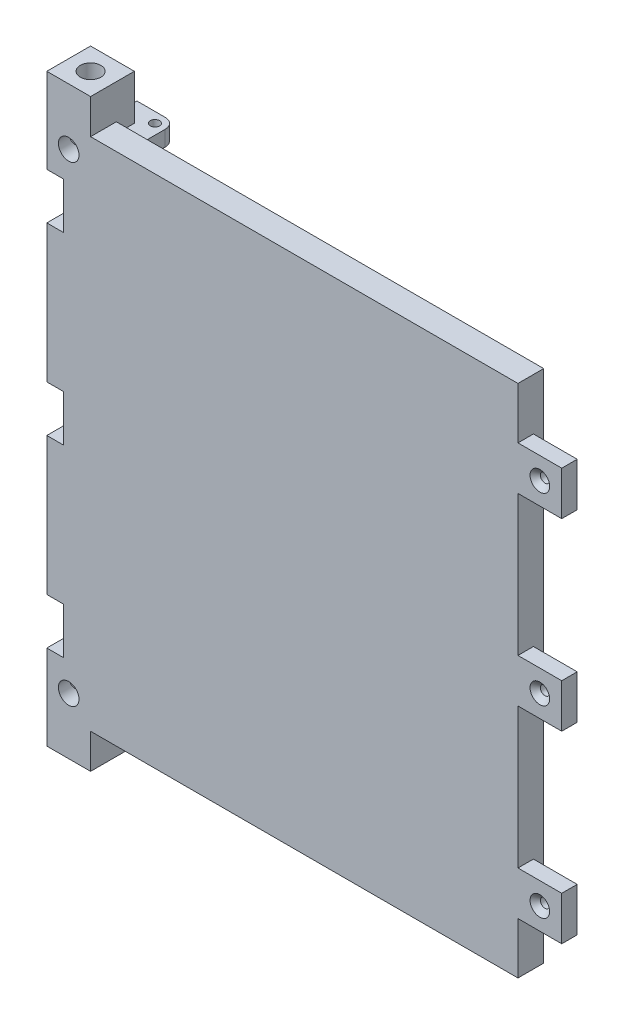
ISO-10303-21;
HEADER;
FILE_DESCRIPTION(('STEP AP214'),'2;1');
FILE_NAME('part.step','',(''),(''),'','','');
FILE_SCHEMA(('AUTOMOTIVE_DESIGN { 1 0 10303 214 1 1 1 1 }'));
ENDSEC;
DATA;
#1=APPLICATION_CONTEXT('core data for automotive mechanical design processes');
#2=APPLICATION_PROTOCOL_DEFINITION('international standard','automotive_design',2000,#1);
#3=PRODUCT_CONTEXT('',#1,'mechanical');
#4=PRODUCT('Part','Part','',(#3));
#5=PRODUCT_RELATED_PRODUCT_CATEGORY('part','',(#4));
#6=PRODUCT_DEFINITION_FORMATION('','',#4);
#7=PRODUCT_DEFINITION_CONTEXT('part definition',#1,'design');
#8=PRODUCT_DEFINITION('design','',#6,#7);
#9=PRODUCT_DEFINITION_SHAPE('','',#8);
#10=(LENGTH_UNIT() NAMED_UNIT(*) SI_UNIT(.MILLI.,.METRE.));
#11=(NAMED_UNIT(*) PLANE_ANGLE_UNIT() SI_UNIT($,.RADIAN.));
#12=(NAMED_UNIT(*) SI_UNIT($,.STERADIAN.) SOLID_ANGLE_UNIT());
#13=UNCERTAINTY_MEASURE_WITH_UNIT(LENGTH_MEASURE(1.E-05),#10,'distance_accuracy_value','');
#14=(GEOMETRIC_REPRESENTATION_CONTEXT(3) GLOBAL_UNCERTAINTY_ASSIGNED_CONTEXT((#13)) GLOBAL_UNIT_ASSIGNED_CONTEXT((#10,
#11,#12)) REPRESENTATION_CONTEXT('',''));
#15=CARTESIAN_POINT('',(0.,0.,0.));
#16=DIRECTION('',(0.,0.,1.));
#17=DIRECTION('',(1.,0.,0.));
#18=AXIS2_PLACEMENT_3D('',#15,#16,#17);
#19=CARTESIAN_POINT('',(-41.5,56.75,41.5));
#20=DIRECTION('',(-1.,0.,0.));
#21=DIRECTION('',(0.,0.,1.));
#22=AXIS2_PLACEMENT_3D('',#19,#20,#21);
#23=PLANE('',#22);
#24=DIRECTION('',(0.,0.,1.));
#25=VECTOR('',#24,1.);
#26=CARTESIAN_POINT('',(-41.5,-48.,45.));
#27=LINE('',#26,#25);
#28=CARTESIAN_POINT('',(-41.5,-48.,41.5));
#29=VERTEX_POINT('',#28);
#30=CARTESIAN_POINT('',(-41.5,-48.,45.));
#31=VERTEX_POINT('',#30);
#32=EDGE_CURVE('E423',#29,#31,#27,.T.);
#33=ORIENTED_EDGE('',*,*,#32,.T.);
#34=DIRECTION('',(0.,-1.,0.));
#35=VECTOR('',#34,1.);
#36=CARTESIAN_POINT('',(-41.5,50.,45.));
#37=LINE('',#36,#35);
#38=CARTESIAN_POINT('',(-41.5,-50.,45.));
#39=VERTEX_POINT('',#38);
#40=EDGE_CURVE('E740',#31,#39,#37,.T.);
#41=ORIENTED_EDGE('',*,*,#40,.T.);
#42=DIRECTION('',(0.,0.,1.));
#43=VECTOR('',#42,1.);
#44=CARTESIAN_POINT('',(-41.5,-50.,50.));
#45=LINE('',#44,#43);
#46=CARTESIAN_POINT('',(-41.5,-50.,50.));
#47=VERTEX_POINT('',#46);
#48=EDGE_CURVE('E694',#39,#47,#45,.T.);
#49=ORIENTED_EDGE('',*,*,#48,.T.);
#50=DIRECTION('',(0.,-1.,0.));
#51=VECTOR('',#50,1.);
#52=CARTESIAN_POINT('',(-41.5,56.75,50.));
#53=LINE('',#52,#51);
#54=CARTESIAN_POINT('',(-41.5,-56.75,50.));
#55=VERTEX_POINT('',#54);
#56=EDGE_CURVE('E760',#47,#55,#53,.T.);
#57=ORIENTED_EDGE('',*,*,#56,.T.);
#58=DIRECTION('',(0.,0.,-1.));
#59=VECTOR('',#58,1.);
#60=CARTESIAN_POINT('',(-41.5,-56.75,41.5));
#61=LINE('',#60,#59);
#62=CARTESIAN_POINT('',(-41.5,-56.75,41.5));
#63=VERTEX_POINT('',#62);
#64=EDGE_CURVE('E847',#55,#63,#61,.T.);
#65=ORIENTED_EDGE('',*,*,#64,.T.);
#66=DIRECTION('',(0.,-1.,0.));
#67=VECTOR('',#66,1.);
#68=CARTESIAN_POINT('',(-41.5,56.75,41.5));
#69=LINE('',#68,#67);
#70=EDGE_CURVE('E831',#29,#63,#69,.T.);
#71=ORIENTED_EDGE('',*,*,#70,.F.);
#72=EDGE_LOOP('',(#33,#41,#49,#57,#65,#71));
#73=FACE_BOUND('',#72,.T.);
#74=ADVANCED_FACE('F32',(#73),#23,.F.);
#75=DIRECTION('',(0.,0.,1.));
#76=VECTOR('',#75,1.);
#77=CARTESIAN_POINT('',(-41.5,48.,45.));
#78=LINE('',#77,#76);
#79=CARTESIAN_POINT('',(-41.5,48.,41.5));
#80=VERTEX_POINT('',#79);
#81=CARTESIAN_POINT('',(-41.5,48.,45.));
#82=VERTEX_POINT('',#81);
#83=EDGE_CURVE('E500',#80,#82,#78,.T.);
#84=ORIENTED_EDGE('',*,*,#83,.F.);
#85=CARTESIAN_POINT('',(-41.5,56.75,41.5));
#86=VERTEX_POINT('',#85);
#87=EDGE_CURVE('E830',#86,#80,#69,.T.);
#88=ORIENTED_EDGE('',*,*,#87,.F.);
#89=DIRECTION('',(0.,0.,-1.));
#90=VECTOR('',#89,1.);
#91=CARTESIAN_POINT('',(-41.5,56.75,41.5));
#92=LINE('',#91,#90);
#93=CARTESIAN_POINT('',(-41.5,56.75,50.));
#94=VERTEX_POINT('',#93);
#95=EDGE_CURVE('E865',#94,#86,#92,.T.);
#96=ORIENTED_EDGE('',*,*,#95,.F.);
#97=CARTESIAN_POINT('',(-41.5,50.,50.));
#98=VERTEX_POINT('',#97);
#99=EDGE_CURVE('E784',#94,#98,#53,.T.);
#100=ORIENTED_EDGE('',*,*,#99,.T.);
#101=DIRECTION('',(0.,0.,1.));
#102=VECTOR('',#101,1.);
#103=CARTESIAN_POINT('',(-41.5,50.,50.));
#104=LINE('',#103,#102);
#105=CARTESIAN_POINT('',(-41.5,50.,45.));
#106=VERTEX_POINT('',#105);
#107=EDGE_CURVE('E736',#106,#98,#104,.T.);
#108=ORIENTED_EDGE('',*,*,#107,.F.);
#109=EDGE_CURVE('E737',#106,#82,#37,.T.);
#110=ORIENTED_EDGE('',*,*,#109,.T.);
#111=EDGE_LOOP('',(#84,#88,#96,#100,#108,#110));
#112=FACE_BOUND('',#111,.T.);
#113=ADVANCED_FACE('F781',(#112),#23,.F.);
#114=CARTESIAN_POINT('',(-50.,56.75,41.5));
#115=DIRECTION('',(1.,0.,0.));
#116=DIRECTION('',(0.,0.,-1.));
#117=AXIS2_PLACEMENT_3D('',#114,#115,#116);
#118=PLANE('',#117);
#119=CARTESIAN_POINT('',(-50.,-45.7499999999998,45.75));
#120=DIRECTION('',(-1.,0.,0.));
#121=DIRECTION('',(0.,0.,-1.));
#122=AXIS2_PLACEMENT_3D('',#119,#120,#121);
#123=CIRCLE('',#122,2.);
#124=CARTESIAN_POINT('',(-50.,-45.7499999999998,43.75));
#125=VERTEX_POINT('',#124);
#126=EDGE_CURVE('E1207',#125,#125,#123,.T.);
#127=ORIENTED_EDGE('',*,*,#126,.F.);
#128=EDGE_LOOP('',(#127));
#129=FACE_BOUND('',#128,.T.);
#130=DIRECTION('',(0.,-1.,0.));
#131=VECTOR('',#130,1.);
#132=CARTESIAN_POINT('',(-50.,56.75,50.));
#133=LINE('',#132,#131);
#134=CARTESIAN_POINT('',(-50.,-40.25,50.));
#135=VERTEX_POINT('',#134);
#136=CARTESIAN_POINT('',(-50.,-56.75,50.));
#137=VERTEX_POINT('',#136);
#138=EDGE_CURVE('E841',#135,#137,#133,.T.);
#139=ORIENTED_EDGE('',*,*,#138,.F.);
#140=DIRECTION('',(0.,0.,1.));
#141=VECTOR('',#140,1.);
#142=CARTESIAN_POINT('',(-50.,-40.25,41.5));
#143=LINE('',#142,#141);
#144=CARTESIAN_POINT('',(-50.,-40.25,41.5));
#145=VERTEX_POINT('',#144);
#146=EDGE_CURVE('E536',#145,#135,#143,.T.);
#147=ORIENTED_EDGE('',*,*,#146,.F.);
#148=DIRECTION('',(0.,-1.,0.));
#149=VECTOR('',#148,1.);
#150=CARTESIAN_POINT('',(-50.,56.75,41.5));
#151=LINE('',#150,#149);
#152=CARTESIAN_POINT('',(-50.,-56.75,41.5));
#153=VERTEX_POINT('',#152);
#154=EDGE_CURVE('E864',#145,#153,#151,.T.);
#155=ORIENTED_EDGE('',*,*,#154,.T.);
#156=DIRECTION('',(0.,0.,1.));
#157=VECTOR('',#156,1.);
#158=CARTESIAN_POINT('',(-50.,-56.75,41.5));
#159=LINE('',#158,#157);
#160=EDGE_CURVE('E722',#153,#137,#159,.T.);
#161=ORIENTED_EDGE('',*,*,#160,.T.);
#162=EDGE_LOOP('',(#139,#147,#155,#161));
#163=FACE_BOUND('',#162,.T.);
#164=ADVANCED_FACE('F803',(#129,#163),#118,.F.);
#165=CARTESIAN_POINT('',(-50.,31.25,50.));
#166=VERTEX_POINT('',#165);
#167=CARTESIAN_POINT('',(-50.,4.49999999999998,50.));
#168=VERTEX_POINT('',#167);
#169=EDGE_CURVE('E843',#166,#168,#133,.T.);
#170=ORIENTED_EDGE('',*,*,#169,.F.);
#171=DIRECTION('',(0.,0.,1.));
#172=VECTOR('',#171,1.);
#173=CARTESIAN_POINT('',(-50.,31.25,41.5));
#174=LINE('',#173,#172);
#175=CARTESIAN_POINT('',(-50.,31.25,41.5));
#176=VERTEX_POINT('',#175);
#177=EDGE_CURVE('E563',#176,#166,#174,.T.);
#178=ORIENTED_EDGE('',*,*,#177,.F.);
#179=CARTESIAN_POINT('',(-50.,4.49999999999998,41.5));
#180=VERTEX_POINT('',#179);
#181=EDGE_CURVE('E902',#176,#180,#151,.T.);
#182=ORIENTED_EDGE('',*,*,#181,.T.);
#183=DIRECTION('',(0.,0.,1.));
#184=VECTOR('',#183,1.);
#185=CARTESIAN_POINT('',(-50.,4.49999999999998,41.5));
#186=LINE('',#185,#184);
#187=EDGE_CURVE('E582',#180,#168,#186,.T.);
#188=ORIENTED_EDGE('',*,*,#187,.T.);
#189=EDGE_LOOP('',(#170,#178,#182,#188));
#190=FACE_BOUND('',#189,.T.);
#191=ADVANCED_FACE('F1114',(#190),#118,.F.);
#192=CARTESIAN_POINT('',(-50.,45.7499999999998,45.75));
#193=DIRECTION('',(-1.,0.,0.));
#194=DIRECTION('',(0.,0.,1.));
#195=AXIS2_PLACEMENT_3D('',#192,#193,#194);
#196=CIRCLE('',#195,2.);
#197=CARTESIAN_POINT('',(-50.,45.7499999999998,47.75));
#198=VERTEX_POINT('',#197);
#199=EDGE_CURVE('E1197',#198,#198,#196,.T.);
#200=ORIENTED_EDGE('',*,*,#199,.F.);
#201=EDGE_LOOP('',(#200));
#202=FACE_BOUND('',#201,.T.);
#203=CARTESIAN_POINT('',(-50.,56.75,41.5));
#204=VERTEX_POINT('',#203);
#205=CARTESIAN_POINT('',(-50.,40.25,41.5));
#206=VERTEX_POINT('',#205);
#207=EDGE_CURVE('E834',#204,#206,#151,.T.);
#208=ORIENTED_EDGE('',*,*,#207,.T.);
#209=DIRECTION('',(0.,0.,1.));
#210=VECTOR('',#209,1.);
#211=CARTESIAN_POINT('',(-50.,40.25,41.5));
#212=LINE('',#211,#210);
#213=CARTESIAN_POINT('',(-50.,40.25,50.));
#214=VERTEX_POINT('',#213);
#215=EDGE_CURVE('E566',#206,#214,#212,.T.);
#216=ORIENTED_EDGE('',*,*,#215,.T.);
#217=CARTESIAN_POINT('',(-50.,56.75,50.));
#218=VERTEX_POINT('',#217);
#219=EDGE_CURVE('E839',#218,#214,#133,.T.);
#220=ORIENTED_EDGE('',*,*,#219,.F.);
#221=DIRECTION('',(0.,0.,1.));
#222=VECTOR('',#221,1.);
#223=CARTESIAN_POINT('',(-50.,56.75,41.5));
#224=LINE('',#223,#222);
#225=EDGE_CURVE('E711',#204,#218,#224,.T.);
#226=ORIENTED_EDGE('',*,*,#225,.F.);
#227=EDGE_LOOP('',(#208,#216,#220,#226));
#228=FACE_BOUND('',#227,.T.);
#229=ADVANCED_FACE('F876',(#202,#228),#118,.F.);
#230=CARTESIAN_POINT('',(41.5,50.,45.));
#231=DIRECTION('',(-1.,0.,0.));
#232=DIRECTION('',(0.,0.,1.));
#233=AXIS2_PLACEMENT_3D('',#230,#231,#232);
#234=PLANE('',#233);
#235=DIRECTION('',(0.,-1.,0.));
#236=VECTOR('',#235,1.);
#237=CARTESIAN_POINT('',(41.5,-4.25,47.));
#238=LINE('',#237,#236);
#239=CARTESIAN_POINT('',(41.5,4.25,47.));
#240=VERTEX_POINT('',#239);
#241=CARTESIAN_POINT('',(41.5,-4.25,47.));
#242=VERTEX_POINT('',#241);
#243=EDGE_CURVE('E607',#240,#242,#238,.T.);
#244=ORIENTED_EDGE('',*,*,#243,.T.);
#245=DIRECTION('',(0.,0.,1.));
#246=VECTOR('',#245,1.);
#247=CARTESIAN_POINT('',(41.5,-4.25,47.));
#248=LINE('',#247,#246);
#249=CARTESIAN_POINT('',(41.5,-4.25,50.));
#250=VERTEX_POINT('',#249);
#251=EDGE_CURVE('E624',#242,#250,#248,.T.);
#252=ORIENTED_EDGE('',*,*,#251,.T.);
#253=DIRECTION('',(0.,-1.,0.));
#254=VECTOR('',#253,1.);
#255=CARTESIAN_POINT('',(41.5,50.,50.));
#256=LINE('',#255,#254);
#257=CARTESIAN_POINT('',(41.5,-31.5,50.));
#258=VERTEX_POINT('',#257);
#259=EDGE_CURVE('E704',#250,#258,#256,.T.);
#260=ORIENTED_EDGE('',*,*,#259,.T.);
#261=DIRECTION('',(0.,0.,1.));
#262=VECTOR('',#261,1.);
#263=CARTESIAN_POINT('',(41.5,-31.5,47.));
#264=LINE('',#263,#262);
#265=CARTESIAN_POINT('',(41.5,-31.5,47.));
#266=VERTEX_POINT('',#265);
#267=EDGE_CURVE('E651',#266,#258,#264,.T.);
#268=ORIENTED_EDGE('',*,*,#267,.F.);
#269=DIRECTION('',(0.,-1.,0.));
#270=VECTOR('',#269,1.);
#271=CARTESIAN_POINT('',(41.5,-31.5,47.));
#272=LINE('',#271,#270);
#273=CARTESIAN_POINT('',(41.5,-40.,47.));
#274=VERTEX_POINT('',#273);
#275=EDGE_CURVE('E631',#266,#274,#272,.T.);
#276=ORIENTED_EDGE('',*,*,#275,.T.);
#277=DIRECTION('',(0.,0.,1.));
#278=VECTOR('',#277,1.);
#279=CARTESIAN_POINT('',(41.5,-40.,47.));
#280=LINE('',#279,#278);
#281=CARTESIAN_POINT('',(41.5,-40.,50.));
#282=VERTEX_POINT('',#281);
#283=EDGE_CURVE('E643',#274,#282,#280,.T.);
#284=ORIENTED_EDGE('',*,*,#283,.T.);
#285=CARTESIAN_POINT('',(41.5,-50.,50.));
#286=VERTEX_POINT('',#285);
#287=EDGE_CURVE('E701',#282,#286,#256,.T.);
#288=ORIENTED_EDGE('',*,*,#287,.T.);
#289=DIRECTION('',(0.,0.,-1.));
#290=VECTOR('',#289,1.);
#291=CARTESIAN_POINT('',(41.5,-50.,45.));
#292=LINE('',#291,#290);
#293=CARTESIAN_POINT('',(41.5,-50.,45.));
#294=VERTEX_POINT('',#293);
#295=EDGE_CURVE('E732',#286,#294,#292,.T.);
#296=ORIENTED_EDGE('',*,*,#295,.T.);
#297=DIRECTION('',(0.,-1.,0.));
#298=VECTOR('',#297,1.);
#299=CARTESIAN_POINT('',(41.5,50.,45.));
#300=LINE('',#299,#298);
#301=CARTESIAN_POINT('',(41.5,50.,45.));
#302=VERTEX_POINT('',#301);
#303=EDGE_CURVE('E705',#302,#294,#300,.T.);
#304=ORIENTED_EDGE('',*,*,#303,.F.);
#305=DIRECTION('',(0.,0.,-1.));
#306=VECTOR('',#305,1.);
#307=CARTESIAN_POINT('',(41.5,50.,45.));
#308=LINE('',#307,#306);
#309=CARTESIAN_POINT('',(41.5,50.,50.));
#310=VERTEX_POINT('',#309);
#311=EDGE_CURVE('E685',#310,#302,#308,.T.);
#312=ORIENTED_EDGE('',*,*,#311,.F.);
#313=CARTESIAN_POINT('',(41.5,40.,50.));
#314=VERTEX_POINT('',#313);
#315=EDGE_CURVE('E719',#310,#314,#256,.T.);
#316=ORIENTED_EDGE('',*,*,#315,.T.);
#317=DIRECTION('',(0.,0.,1.));
#318=VECTOR('',#317,1.);
#319=CARTESIAN_POINT('',(41.5,40.,47.));
#320=LINE('',#319,#318);
#321=CARTESIAN_POINT('',(41.5,40.,47.));
#322=VERTEX_POINT('',#321);
#323=EDGE_CURVE('E680',#322,#314,#320,.T.);
#324=ORIENTED_EDGE('',*,*,#323,.F.);
#325=DIRECTION('',(0.,-1.,0.));
#326=VECTOR('',#325,1.);
#327=CARTESIAN_POINT('',(41.5,40.,47.));
#328=LINE('',#327,#326);
#329=CARTESIAN_POINT('',(41.5,31.5,47.));
#330=VERTEX_POINT('',#329);
#331=EDGE_CURVE('E661',#322,#330,#328,.T.);
#332=ORIENTED_EDGE('',*,*,#331,.T.);
#333=DIRECTION('',(0.,0.,1.));
#334=VECTOR('',#333,1.);
#335=CARTESIAN_POINT('',(41.5,31.5,47.));
#336=LINE('',#335,#334);
#337=CARTESIAN_POINT('',(41.5,31.5,50.));
#338=VERTEX_POINT('',#337);
#339=EDGE_CURVE('E674',#330,#338,#336,.T.);
#340=ORIENTED_EDGE('',*,*,#339,.T.);
#341=CARTESIAN_POINT('',(41.5,4.25,50.));
#342=VERTEX_POINT('',#341);
#343=EDGE_CURVE('E716',#338,#342,#256,.T.);
#344=ORIENTED_EDGE('',*,*,#343,.T.);
#345=DIRECTION('',(0.,0.,1.));
#346=VECTOR('',#345,1.);
#347=CARTESIAN_POINT('',(41.5,4.25,47.));
#348=LINE('',#347,#346);
#349=EDGE_CURVE('E627',#240,#342,#348,.T.);
#350=ORIENTED_EDGE('',*,*,#349,.F.);
#351=EDGE_LOOP('',(#244,#252,#260,#268,#276,#284,#288,#296,#304,#312,#316,#324,#332,#340,#344,#350));
#352=FACE_BOUND('',#351,.T.);
#353=ADVANCED_FACE('F777',(#352),#234,.F.);
#354=CARTESIAN_POINT('',(-50.,-4.50000000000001,41.5));
#355=VERTEX_POINT('',#354);
#356=CARTESIAN_POINT('',(-50.,-31.25,41.5));
#357=VERTEX_POINT('',#356);
#358=EDGE_CURVE('E891',#355,#357,#151,.T.);
#359=ORIENTED_EDGE('',*,*,#358,.T.);
#360=DIRECTION('',(0.,0.,1.));
#361=VECTOR('',#360,1.);
#362=CARTESIAN_POINT('',(-50.,-31.25,41.5));
#363=LINE('',#362,#361);
#364=CARTESIAN_POINT('',(-50.,-31.25,50.));
#365=VERTEX_POINT('',#364);
#366=EDGE_CURVE('E539',#357,#365,#363,.T.);
#367=ORIENTED_EDGE('',*,*,#366,.T.);
#368=CARTESIAN_POINT('',(-50.,-4.50000000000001,50.));
#369=VERTEX_POINT('',#368);
#370=EDGE_CURVE('E842',#369,#365,#133,.T.);
#371=ORIENTED_EDGE('',*,*,#370,.F.);
#372=DIRECTION('',(0.,0.,1.));
#373=VECTOR('',#372,1.);
#374=CARTESIAN_POINT('',(-50.,-4.50000000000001,41.5));
#375=LINE('',#374,#373);
#376=EDGE_CURVE('E596',#355,#369,#375,.T.);
#377=ORIENTED_EDGE('',*,*,#376,.F.);
#378=EDGE_LOOP('',(#359,#367,#371,#377));
#379=FACE_BOUND('',#378,.T.);
#380=ADVANCED_FACE('F815',(#379),#118,.F.);
#381=CARTESIAN_POINT('',(-41.5,56.75,50.));
#382=DIRECTION('',(0.,0.,-1.));
#383=DIRECTION('',(-1.,0.,0.));
#384=AXIS2_PLACEMENT_3D('',#381,#382,#383);
#385=PLANE('',#384);
#386=CARTESIAN_POINT('',(-45.75,45.7499999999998,50.));
#387=DIRECTION('',(0.,0.,-1.));
#388=DIRECTION('',(-1.,0.,0.));
#389=AXIS2_PLACEMENT_3D('',#386,#387,#388);
#390=CIRCLE('',#389,2.);
#391=CARTESIAN_POINT('',(-47.75,45.7499999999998,50.));
#392=VERTEX_POINT('',#391);
#393=EDGE_CURVE('E382',#392,#392,#390,.T.);
#394=ORIENTED_EDGE('',*,*,#393,.T.);
#395=EDGE_LOOP('',(#394));
#396=FACE_BOUND('',#395,.T.);
#397=CARTESIAN_POINT('',(-45.75,-45.7499999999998,50.));
#398=DIRECTION('',(0.,0.,-1.));
#399=DIRECTION('',(-1.,0.,0.));
#400=AXIS2_PLACEMENT_3D('',#397,#398,#399);
#401=CIRCLE('',#400,2.);
#402=CARTESIAN_POINT('',(-47.75,-45.7499999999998,50.));
#403=VERTEX_POINT('',#402);
#404=EDGE_CURVE('E379',#403,#403,#401,.T.);
#405=ORIENTED_EDGE('',*,*,#404,.T.);
#406=EDGE_LOOP('',(#405));
#407=FACE_BOUND('',#406,.T.);
#408=CARTESIAN_POINT('',(45.75,-35.75,50.));
#409=DIRECTION('',(0.,0.,-1.));
#410=DIRECTION('',(-1.,0.,0.));
#411=AXIS2_PLACEMENT_3D('',#408,#409,#410);
#412=CIRCLE('',#411,1.90000000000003);
#413=CARTESIAN_POINT('',(43.85,-35.75,50.));
#414=VERTEX_POINT('',#413);
#415=EDGE_CURVE('E1151',#414,#414,#412,.T.);
#416=ORIENTED_EDGE('',*,*,#415,.T.);
#417=EDGE_LOOP('',(#416));
#418=FACE_BOUND('',#417,.T.);
#419=CARTESIAN_POINT('',(45.75,0.,50.));
#420=DIRECTION('',(0.,0.,-1.));
#421=DIRECTION('',(-1.,0.,0.));
#422=AXIS2_PLACEMENT_3D('',#419,#420,#421);
#423=CIRCLE('',#422,1.90000000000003);
#424=CARTESIAN_POINT('',(43.85,0.,50.));
#425=VERTEX_POINT('',#424);
#426=EDGE_CURVE('E1146',#425,#425,#423,.T.);
#427=ORIENTED_EDGE('',*,*,#426,.T.);
#428=EDGE_LOOP('',(#427));
#429=FACE_BOUND('',#428,.T.);
#430=CARTESIAN_POINT('',(45.75,35.75,50.));
#431=DIRECTION('',(0.,0.,-1.));
#432=DIRECTION('',(-1.,0.,0.));
#433=AXIS2_PLACEMENT_3D('',#430,#431,#432);
#434=CIRCLE('',#433,1.90000000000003);
#435=CARTESIAN_POINT('',(43.85,35.75,50.));
#436=VERTEX_POINT('',#435);
#437=EDGE_CURVE('E880',#436,#436,#434,.T.);
#438=ORIENTED_EDGE('',*,*,#437,.T.);
#439=EDGE_LOOP('',(#438));
#440=FACE_BOUND('',#439,.T.);
#441=DIRECTION('',(0.,1.,0.));
#442=VECTOR('',#441,1.);
#443=CARTESIAN_POINT('',(-46.8,-31.25,50.));
#444=LINE('',#443,#442);
#445=CARTESIAN_POINT('',(-46.8,-40.25,50.));
#446=VERTEX_POINT('',#445);
#447=CARTESIAN_POINT('',(-46.8,-31.25,50.));
#448=VERTEX_POINT('',#447);
#449=EDGE_CURVE('E532',#446,#448,#444,.T.);
#450=ORIENTED_EDGE('',*,*,#449,.F.);
#451=DIRECTION('',(1.,0.,0.));
#452=VECTOR('',#451,1.);
#453=CARTESIAN_POINT('',(-46.8,-40.25,50.));
#454=LINE('',#453,#452);
#455=EDGE_CURVE('E510',#135,#446,#454,.T.);
#456=ORIENTED_EDGE('',*,*,#455,.F.);
#457=ORIENTED_EDGE('',*,*,#138,.T.);
#458=DIRECTION('',(1.,0.,0.));
#459=VECTOR('',#458,1.);
#460=CARTESIAN_POINT('',(-41.5,-56.75,50.));
#461=LINE('',#460,#459);
#462=EDGE_CURVE('E850',#137,#55,#461,.T.);
#463=ORIENTED_EDGE('',*,*,#462,.T.);
#464=ORIENTED_EDGE('',*,*,#56,.F.);
#465=DIRECTION('',(1.,0.,0.));
#466=VECTOR('',#465,1.);
#467=CARTESIAN_POINT('',(-41.5,-50.,50.));
#468=LINE('',#467,#466);
#469=EDGE_CURVE('E726',#47,#286,#468,.T.);
#470=ORIENTED_EDGE('',*,*,#469,.T.);
#471=ORIENTED_EDGE('',*,*,#287,.F.);
#472=DIRECTION('',(1.,0.,0.));
#473=VECTOR('',#472,1.);
#474=CARTESIAN_POINT('',(50.,-40.,50.));
#475=LINE('',#474,#473);
#476=CARTESIAN_POINT('',(50.,-40.,50.));
#477=VERTEX_POINT('',#476);
#478=EDGE_CURVE('E623',#282,#477,#475,.T.);
#479=ORIENTED_EDGE('',*,*,#478,.T.);
#480=DIRECTION('',(0.,1.,0.));
#481=VECTOR('',#480,1.);
#482=CARTESIAN_POINT('',(50.,-31.5,50.));
#483=LINE('',#482,#481);
#484=CARTESIAN_POINT('',(50.,-31.5,50.));
#485=VERTEX_POINT('',#484);
#486=EDGE_CURVE('E646',#477,#485,#483,.T.);
#487=ORIENTED_EDGE('',*,*,#486,.T.);
#488=DIRECTION('',(-1.,0.,0.));
#489=VECTOR('',#488,1.);
#490=CARTESIAN_POINT('',(50.,-31.5,50.));
#491=LINE('',#490,#489);
#492=EDGE_CURVE('E634',#485,#258,#491,.T.);
#493=ORIENTED_EDGE('',*,*,#492,.T.);
#494=ORIENTED_EDGE('',*,*,#259,.F.);
#495=DIRECTION('',(1.,0.,0.));
#496=VECTOR('',#495,1.);
#497=CARTESIAN_POINT('',(41.5,-4.25,50.));
#498=LINE('',#497,#496);
#499=CARTESIAN_POINT('',(50.,-4.25,50.));
#500=VERTEX_POINT('',#499);
#501=EDGE_CURVE('E604',#250,#500,#498,.T.);
#502=ORIENTED_EDGE('',*,*,#501,.T.);
#503=DIRECTION('',(0.,1.,0.));
#504=VECTOR('',#503,1.);
#505=CARTESIAN_POINT('',(50.,-4.25,50.));
#506=LINE('',#505,#504);
#507=CARTESIAN_POINT('',(50.,4.25,50.));
#508=VERTEX_POINT('',#507);
#509=EDGE_CURVE('E613',#500,#508,#506,.T.);
#510=ORIENTED_EDGE('',*,*,#509,.T.);
#511=DIRECTION('',(-1.,0.,0.));
#512=VECTOR('',#511,1.);
#513=CARTESIAN_POINT('',(41.5,4.25,50.));
#514=LINE('',#513,#512);
#515=EDGE_CURVE('E616',#508,#342,#514,.T.);
#516=ORIENTED_EDGE('',*,*,#515,.T.);
#517=ORIENTED_EDGE('',*,*,#343,.F.);
#518=DIRECTION('',(1.,0.,0.));
#519=VECTOR('',#518,1.);
#520=CARTESIAN_POINT('',(50.,31.5,50.));
#521=LINE('',#520,#519);
#522=CARTESIAN_POINT('',(50.,31.5,50.));
#523=VERTEX_POINT('',#522);
#524=EDGE_CURVE('E654',#338,#523,#521,.T.);
#525=ORIENTED_EDGE('',*,*,#524,.T.);
#526=DIRECTION('',(0.,1.,0.));
#527=VECTOR('',#526,1.);
#528=CARTESIAN_POINT('',(50.,40.,50.));
#529=LINE('',#528,#527);
#530=CARTESIAN_POINT('',(50.,40.,50.));
#531=VERTEX_POINT('',#530);
#532=EDGE_CURVE('E675',#523,#531,#529,.T.);
#533=ORIENTED_EDGE('',*,*,#532,.T.);
#534=DIRECTION('',(-1.,0.,0.));
#535=VECTOR('',#534,1.);
#536=CARTESIAN_POINT('',(50.,40.,50.));
#537=LINE('',#536,#535);
#538=EDGE_CURVE('E665',#531,#314,#537,.T.);
#539=ORIENTED_EDGE('',*,*,#538,.T.);
#540=ORIENTED_EDGE('',*,*,#315,.F.);
#541=DIRECTION('',(1.,0.,0.));
#542=VECTOR('',#541,1.);
#543=CARTESIAN_POINT('',(-41.5,50.,50.));
#544=LINE('',#543,#542);
#545=EDGE_CURVE('E752',#98,#310,#544,.T.);
#546=ORIENTED_EDGE('',*,*,#545,.F.);
#547=ORIENTED_EDGE('',*,*,#99,.F.);
#548=DIRECTION('',(1.,0.,0.));
#549=VECTOR('',#548,1.);
#550=CARTESIAN_POINT('',(-41.5,56.75,50.));
#551=LINE('',#550,#549);
#552=EDGE_CURVE('E866',#218,#94,#551,.T.);
#553=ORIENTED_EDGE('',*,*,#552,.F.);
#554=ORIENTED_EDGE('',*,*,#219,.T.);
#555=DIRECTION('',(-1.,0.,0.));
#556=VECTOR('',#555,1.);
#557=CARTESIAN_POINT('',(-50.,40.25,50.));
#558=LINE('',#557,#556);
#559=CARTESIAN_POINT('',(-46.8,40.25,50.));
#560=VERTEX_POINT('',#559);
#561=EDGE_CURVE('E549',#560,#214,#558,.T.);
#562=ORIENTED_EDGE('',*,*,#561,.F.);
#563=DIRECTION('',(0.,1.,0.));
#564=VECTOR('',#563,1.);
#565=CARTESIAN_POINT('',(-46.8,40.25,50.));
#566=LINE('',#565,#564);
#567=CARTESIAN_POINT('',(-46.8,31.25,50.));
#568=VERTEX_POINT('',#567);
#569=EDGE_CURVE('E559',#568,#560,#566,.T.);
#570=ORIENTED_EDGE('',*,*,#569,.F.);
#571=DIRECTION('',(1.,0.,0.));
#572=VECTOR('',#571,1.);
#573=CARTESIAN_POINT('',(-46.8,31.25,50.));
#574=LINE('',#573,#572);
#575=EDGE_CURVE('E556',#166,#568,#574,.T.);
#576=ORIENTED_EDGE('',*,*,#575,.F.);
#577=ORIENTED_EDGE('',*,*,#169,.T.);
#578=DIRECTION('',(-1.,0.,0.));
#579=VECTOR('',#578,1.);
#580=CARTESIAN_POINT('',(-50.,4.49999999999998,50.));
#581=LINE('',#580,#579);
#582=CARTESIAN_POINT('',(-46.8,4.49999999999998,50.));
#583=VERTEX_POINT('',#582);
#584=EDGE_CURVE('E583',#583,#168,#581,.T.);
#585=ORIENTED_EDGE('',*,*,#584,.F.);
#586=DIRECTION('',(0.,1.,0.));
#587=VECTOR('',#586,1.);
#588=CARTESIAN_POINT('',(-46.8,4.49999999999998,50.));
#589=LINE('',#588,#587);
#590=CARTESIAN_POINT('',(-46.8,-4.50000000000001,50.));
#591=VERTEX_POINT('',#590);
#592=EDGE_CURVE('E576',#591,#583,#589,.T.);
#593=ORIENTED_EDGE('',*,*,#592,.F.);
#594=DIRECTION('',(1.,0.,0.));
#595=VECTOR('',#594,1.);
#596=CARTESIAN_POINT('',(-46.8,-4.50000000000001,50.));
#597=LINE('',#596,#595);
#598=EDGE_CURVE('E586',#369,#591,#597,.T.);
#599=ORIENTED_EDGE('',*,*,#598,.F.);
#600=ORIENTED_EDGE('',*,*,#370,.T.);
#601=DIRECTION('',(-1.,0.,0.));
#602=VECTOR('',#601,1.);
#603=CARTESIAN_POINT('',(-50.,-31.25,50.));
#604=LINE('',#603,#602);
#605=EDGE_CURVE('E523',#448,#365,#604,.T.);
#606=ORIENTED_EDGE('',*,*,#605,.F.);
#607=EDGE_LOOP('',(#450,#456,#457,#463,#464,#470,#471,#479,#487,#493,#494,#502,#510,#516,#517,
#525,#533,#539,#540,#546,#547,#553,#554,#562,#570,#576,#577,#585,#593,#599,#600,#606));
#608=FACE_BOUND('',#607,.T.);
#609=ADVANCED_FACE('F771',(#396,#407,#418,#429,#440,#608),#385,.F.);
#610=CARTESIAN_POINT('',(-41.5,45.,45.));
#611=VERTEX_POINT('',#610);
#612=CARTESIAN_POINT('',(-41.5,-45.,45.));
#613=VERTEX_POINT('',#612);
#614=EDGE_CURVE('E739',#611,#613,#37,.T.);
#615=ORIENTED_EDGE('',*,*,#614,.T.);
#616=DIRECTION('',(0.,0.,1.));
#617=VECTOR('',#616,1.);
#618=CARTESIAN_POINT('',(-41.5,-45.,45.));
#619=LINE('',#618,#617);
#620=CARTESIAN_POINT('',(-41.5,-45.,41.5));
#621=VERTEX_POINT('',#620);
#622=EDGE_CURVE('E405',#621,#613,#619,.T.);
#623=ORIENTED_EDGE('',*,*,#622,.F.);
#624=CARTESIAN_POINT('',(-41.5,45.,41.5));
#625=VERTEX_POINT('',#624);
#626=EDGE_CURVE('E828',#625,#621,#69,.T.);
#627=ORIENTED_EDGE('',*,*,#626,.F.);
#628=DIRECTION('',(0.,0.,1.));
#629=VECTOR('',#628,1.);
#630=CARTESIAN_POINT('',(-41.5,45.,45.));
#631=LINE('',#630,#629);
#632=EDGE_CURVE('E481',#625,#611,#631,.T.);
#633=ORIENTED_EDGE('',*,*,#632,.T.);
#634=EDGE_LOOP('',(#615,#623,#627,#633));
#635=FACE_BOUND('',#634,.T.);
#636=ADVANCED_FACE('F799',(#635),#23,.F.);
#637=CARTESIAN_POINT('',(-41.5,56.75,41.5));
#638=DIRECTION('',(0.,0.,1.));
#639=DIRECTION('',(1.,0.,0.));
#640=AXIS2_PLACEMENT_3D('',#637,#638,#639);
#641=PLANE('',#640);
#642=ORIENTED_EDGE('',*,*,#626,.T.);
#643=DIRECTION('',(1.,0.,0.));
#644=VECTOR('',#643,1.);
#645=CARTESIAN_POINT('',(-45.,-45.,41.5));
#646=LINE('',#645,#644);
#647=CARTESIAN_POINT('',(-45.,-45.,41.5));
#648=VERTEX_POINT('',#647);
#649=EDGE_CURVE('E408',#648,#621,#646,.T.);
#650=ORIENTED_EDGE('',*,*,#649,.F.);
#651=DIRECTION('',(0.,-1.,0.));
#652=VECTOR('',#651,1.);
#653=CARTESIAN_POINT('',(-45.,-45.,41.5));
#654=LINE('',#653,#652);
#655=CARTESIAN_POINT('',(-45.,-48.,41.5));
#656=VERTEX_POINT('',#655);
#657=EDGE_CURVE('E438',#648,#656,#654,.T.);
#658=ORIENTED_EDGE('',*,*,#657,.T.);
#659=DIRECTION('',(1.,0.,0.));
#660=VECTOR('',#659,1.);
#661=CARTESIAN_POINT('',(-45.,-48.,41.5));
#662=LINE('',#661,#660);
#663=EDGE_CURVE('E425',#656,#29,#662,.T.);
#664=ORIENTED_EDGE('',*,*,#663,.T.);
#665=ORIENTED_EDGE('',*,*,#70,.T.);
#666=DIRECTION('',(-1.,0.,0.));
#667=VECTOR('',#666,1.);
#668=CARTESIAN_POINT('',(-41.5,-56.75,41.5));
#669=LINE('',#668,#667);
#670=EDGE_CURVE('E858',#63,#153,#669,.T.);
#671=ORIENTED_EDGE('',*,*,#670,.T.);
#672=ORIENTED_EDGE('',*,*,#154,.F.);
#673=DIRECTION('',(1.,0.,0.));
#674=VECTOR('',#673,1.);
#675=CARTESIAN_POINT('',(-46.8,-40.25,41.5));
#676=LINE('',#675,#674);
#677=CARTESIAN_POINT('',(-46.8,-40.25,41.5));
#678=VERTEX_POINT('',#677);
#679=EDGE_CURVE('E519',#145,#678,#676,.T.);
#680=ORIENTED_EDGE('',*,*,#679,.T.);
#681=DIRECTION('',(0.,1.,0.));
#682=VECTOR('',#681,1.);
#683=CARTESIAN_POINT('',(-46.8,-31.25,41.5));
#684=LINE('',#683,#682);
#685=CARTESIAN_POINT('',(-46.8,-31.25,41.5));
#686=VERTEX_POINT('',#685);
#687=EDGE_CURVE('E522',#678,#686,#684,.T.);
#688=ORIENTED_EDGE('',*,*,#687,.T.);
#689=DIRECTION('',(-1.,0.,0.));
#690=VECTOR('',#689,1.);
#691=CARTESIAN_POINT('',(-50.,-31.25,41.5));
#692=LINE('',#691,#690);
#693=EDGE_CURVE('E526',#686,#357,#692,.T.);
#694=ORIENTED_EDGE('',*,*,#693,.T.);
#695=ORIENTED_EDGE('',*,*,#358,.F.);
#696=DIRECTION('',(1.,0.,0.));
#697=VECTOR('',#696,1.);
#698=CARTESIAN_POINT('',(-46.8,-4.50000000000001,41.5));
#699=LINE('',#698,#697);
#700=CARTESIAN_POINT('',(-46.8,-4.50000000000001,41.5));
#701=VERTEX_POINT('',#700);
#702=EDGE_CURVE('E575',#355,#701,#699,.T.);
#703=ORIENTED_EDGE('',*,*,#702,.T.);
#704=DIRECTION('',(0.,1.,0.));
#705=VECTOR('',#704,1.);
#706=CARTESIAN_POINT('',(-46.8,4.49999999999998,41.5));
#707=LINE('',#706,#705);
#708=CARTESIAN_POINT('',(-46.8,4.49999999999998,41.5));
#709=VERTEX_POINT('',#708);
#710=EDGE_CURVE('E579',#701,#709,#707,.T.);
#711=ORIENTED_EDGE('',*,*,#710,.T.);
#712=DIRECTION('',(-1.,0.,0.));
#713=VECTOR('',#712,1.);
#714=CARTESIAN_POINT('',(-50.,4.49999999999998,41.5));
#715=LINE('',#714,#713);
#716=EDGE_CURVE('E572',#709,#180,#715,.T.);
#717=ORIENTED_EDGE('',*,*,#716,.T.);
#718=ORIENTED_EDGE('',*,*,#181,.F.);
#719=DIRECTION('',(1.,0.,0.));
#720=VECTOR('',#719,1.);
#721=CARTESIAN_POINT('',(-46.8,31.25,41.5));
#722=LINE('',#721,#720);
#723=CARTESIAN_POINT('',(-46.8,31.25,41.5));
#724=VERTEX_POINT('',#723);
#725=EDGE_CURVE('E545',#176,#724,#722,.T.);
#726=ORIENTED_EDGE('',*,*,#725,.T.);
#727=DIRECTION('',(0.,1.,0.));
#728=VECTOR('',#727,1.);
#729=CARTESIAN_POINT('',(-46.8,40.25,41.5));
#730=LINE('',#729,#728);
#731=CARTESIAN_POINT('',(-46.8,40.25,41.5));
#732=VERTEX_POINT('',#731);
#733=EDGE_CURVE('E548',#724,#732,#730,.T.);
#734=ORIENTED_EDGE('',*,*,#733,.T.);
#735=DIRECTION('',(-1.,0.,0.));
#736=VECTOR('',#735,1.);
#737=CARTESIAN_POINT('',(-50.,40.25,41.5));
#738=LINE('',#737,#736);
#739=EDGE_CURVE('E552',#732,#206,#738,.T.);
#740=ORIENTED_EDGE('',*,*,#739,.T.);
#741=ORIENTED_EDGE('',*,*,#207,.F.);
#742=DIRECTION('',(-1.,0.,0.));
#743=VECTOR('',#742,1.);
#744=CARTESIAN_POINT('',(-41.5,56.75,41.5));
#745=LINE('',#744,#743);
#746=EDGE_CURVE('E862',#86,#204,#745,.T.);
#747=ORIENTED_EDGE('',*,*,#746,.F.);
#748=ORIENTED_EDGE('',*,*,#87,.T.);
#749=DIRECTION('',(1.,0.,0.));
#750=VECTOR('',#749,1.);
#751=CARTESIAN_POINT('',(-45.,48.,41.5));
#752=LINE('',#751,#750);
#753=CARTESIAN_POINT('',(-45.,48.,41.5));
#754=VERTEX_POINT('',#753);
#755=EDGE_CURVE('E497',#754,#80,#752,.T.);
#756=ORIENTED_EDGE('',*,*,#755,.F.);
#757=DIRECTION('',(0.,1.,0.));
#758=VECTOR('',#757,1.);
#759=CARTESIAN_POINT('',(-45.,45.,41.5));
#760=LINE('',#759,#758);
#761=CARTESIAN_POINT('',(-45.,45.,41.5));
#762=VERTEX_POINT('',#761);
#763=EDGE_CURVE('E513',#762,#754,#760,.T.);
#764=ORIENTED_EDGE('',*,*,#763,.F.);
#765=DIRECTION('',(1.,0.,0.));
#766=VECTOR('',#765,1.);
#767=CARTESIAN_POINT('',(-45.,45.,41.5));
#768=LINE('',#767,#766);
#769=EDGE_CURVE('E479',#762,#625,#768,.T.);
#770=ORIENTED_EDGE('',*,*,#769,.T.);
#771=EDGE_LOOP('',(#642,#650,#658,#664,#665,#671,#672,#680,#688,#694,#695,#703,#711,#717,#718,
#726,#734,#740,#741,#747,#748,#756,#764,#770));
#772=FACE_BOUND('',#771,.T.);
#773=ADVANCED_FACE('F807',(#772),#641,.F.);
#774=CARTESIAN_POINT('',(0.,56.75,0.));
#775=DIRECTION('',(0.,-1.,0.));
#776=DIRECTION('',(0.,0.,-1.));
#777=AXIS2_PLACEMENT_3D('',#774,#775,#776);
#778=PLANE('',#777);
#779=CARTESIAN_POINT('',(-45.75,56.75,45.75));
#780=DIRECTION('',(0.,1.,0.));
#781=DIRECTION('',(0.,0.,1.));
#782=AXIS2_PLACEMENT_3D('',#779,#780,#781);
#783=CIRCLE('',#782,2.);
#784=CARTESIAN_POINT('',(-45.75,56.75,47.75));
#785=VERTEX_POINT('',#784);
#786=EDGE_CURVE('E372',#785,#785,#783,.T.);
#787=ORIENTED_EDGE('',*,*,#786,.F.);
#788=EDGE_LOOP('',(#787));
#789=FACE_BOUND('',#788,.T.);
#790=ORIENTED_EDGE('',*,*,#225,.T.);
#791=ORIENTED_EDGE('',*,*,#552,.T.);
#792=ORIENTED_EDGE('',*,*,#95,.T.);
#793=ORIENTED_EDGE('',*,*,#746,.T.);
#794=EDGE_LOOP('',(#790,#791,#792,#793));
#795=FACE_BOUND('',#794,.T.);
#796=ADVANCED_FACE('F813',(#789,#795),#778,.F.);
#797=CARTESIAN_POINT('',(0.,-56.75,0.));
#798=DIRECTION('',(0.,-1.,0.));
#799=DIRECTION('',(0.,0.,-1.));
#800=AXIS2_PLACEMENT_3D('',#797,#798,#799);
#801=PLANE('',#800);
#802=CARTESIAN_POINT('',(-45.75,-56.75,45.75));
#803=DIRECTION('',(0.,1.,0.));
#804=DIRECTION('',(0.,0.,1.));
#805=AXIS2_PLACEMENT_3D('',#802,#803,#804);
#806=CIRCLE('',#805,2.);
#807=CARTESIAN_POINT('',(-45.75,-56.75,47.75));
#808=VERTEX_POINT('',#807);
#809=EDGE_CURVE('E1181',#808,#808,#806,.T.);
#810=ORIENTED_EDGE('',*,*,#809,.T.);
#811=EDGE_LOOP('',(#810));
#812=FACE_BOUND('',#811,.T.);
#813=ORIENTED_EDGE('',*,*,#160,.F.);
#814=ORIENTED_EDGE('',*,*,#670,.F.);
#815=ORIENTED_EDGE('',*,*,#64,.F.);
#816=ORIENTED_EDGE('',*,*,#462,.F.);
#817=EDGE_LOOP('',(#813,#814,#815,#816));
#818=FACE_BOUND('',#817,.T.);
#819=ADVANCED_FACE('F794',(#812,#818),#801,.T.);
#820=CARTESIAN_POINT('',(-41.5,50.,45.));
#821=DIRECTION('',(0.,0.,1.));
#822=DIRECTION('',(1.,0.,0.));
#823=AXIS2_PLACEMENT_3D('',#820,#821,#822);
#824=PLANE('',#823);
#825=DIRECTION('',(0.,-1.,0.));
#826=VECTOR('',#825,1.);
#827=CARTESIAN_POINT('',(-37.5,-45.,45.));
#828=LINE('',#827,#826);
#829=CARTESIAN_POINT('',(-37.5,-45.,45.));
#830=VERTEX_POINT('',#829);
#831=CARTESIAN_POINT('',(-37.5,-48.,45.));
#832=VERTEX_POINT('',#831);
#833=EDGE_CURVE('E440',#830,#832,#828,.T.);
#834=ORIENTED_EDGE('',*,*,#833,.F.);
#835=DIRECTION('',(1.,0.,0.));
#836=VECTOR('',#835,1.);
#837=CARTESIAN_POINT('',(-41.5,-45.,45.));
#838=LINE('',#837,#836);
#839=EDGE_CURVE('E402',#613,#830,#838,.T.);
#840=ORIENTED_EDGE('',*,*,#839,.F.);
#841=ORIENTED_EDGE('',*,*,#614,.F.);
#842=DIRECTION('',(1.,0.,0.));
#843=VECTOR('',#842,1.);
#844=CARTESIAN_POINT('',(-41.5,45.,45.));
#845=LINE('',#844,#843);
#846=CARTESIAN_POINT('',(-37.5,45.,45.));
#847=VERTEX_POINT('',#846);
#848=EDGE_CURVE('E483',#611,#847,#845,.T.);
#849=ORIENTED_EDGE('',*,*,#848,.T.);
#850=DIRECTION('',(0.,1.,0.));
#851=VECTOR('',#850,1.);
#852=CARTESIAN_POINT('',(-37.5,45.,45.));
#853=LINE('',#852,#851);
#854=CARTESIAN_POINT('',(-37.5,48.,45.));
#855=VERTEX_POINT('',#854);
#856=EDGE_CURVE('E511',#847,#855,#853,.T.);
#857=ORIENTED_EDGE('',*,*,#856,.T.);
#858=DIRECTION('',(1.,0.,0.));
#859=VECTOR('',#858,1.);
#860=CARTESIAN_POINT('',(-41.5,48.,45.));
#861=LINE('',#860,#859);
#862=EDGE_CURVE('E503',#82,#855,#861,.T.);
#863=ORIENTED_EDGE('',*,*,#862,.F.);
#864=ORIENTED_EDGE('',*,*,#109,.F.);
#865=DIRECTION('',(-1.,0.,0.));
#866=VECTOR('',#865,1.);
#867=CARTESIAN_POINT('',(-41.5,50.,45.));
#868=LINE('',#867,#866);
#869=EDGE_CURVE('E731',#302,#106,#868,.T.);
#870=ORIENTED_EDGE('',*,*,#869,.F.);
#871=ORIENTED_EDGE('',*,*,#303,.T.);
#872=DIRECTION('',(-1.,0.,0.));
#873=VECTOR('',#872,1.);
#874=CARTESIAN_POINT('',(-41.5,-50.,45.));
#875=LINE('',#874,#873);
#876=EDGE_CURVE('E734',#294,#39,#875,.T.);
#877=ORIENTED_EDGE('',*,*,#876,.T.);
#878=ORIENTED_EDGE('',*,*,#40,.F.);
#879=DIRECTION('',(1.,0.,0.));
#880=VECTOR('',#879,1.);
#881=CARTESIAN_POINT('',(-41.5,-48.,45.));
#882=LINE('',#881,#880);
#883=EDGE_CURVE('E421',#31,#832,#882,.T.);
#884=ORIENTED_EDGE('',*,*,#883,.T.);
#885=EDGE_LOOP('',(#834,#840,#841,#849,#857,#863,#864,#870,#871,#877,#878,#884));
#886=FACE_BOUND('',#885,.T.);
#887=ADVANCED_FACE('F779',(#886),#824,.F.);
#888=CARTESIAN_POINT('',(0.,50.,0.));
#889=DIRECTION('',(0.,-1.,0.));
#890=DIRECTION('',(0.,0.,-1.));
#891=AXIS2_PLACEMENT_3D('',#888,#889,#890);
#892=PLANE('',#891);
#893=ORIENTED_EDGE('',*,*,#107,.T.);
#894=ORIENTED_EDGE('',*,*,#545,.T.);
#895=ORIENTED_EDGE('',*,*,#311,.T.);
#896=ORIENTED_EDGE('',*,*,#869,.T.);
#897=EDGE_LOOP('',(#893,#894,#895,#896));
#898=FACE_BOUND('',#897,.T.);
#899=ADVANCED_FACE('F785',(#898),#892,.F.);
#900=CARTESIAN_POINT('',(0.,-50.,0.));
#901=DIRECTION('',(0.,-1.,0.));
#902=DIRECTION('',(0.,0.,-1.));
#903=AXIS2_PLACEMENT_3D('',#900,#901,#902);
#904=PLANE('',#903);
#905=ORIENTED_EDGE('',*,*,#48,.F.);
#906=ORIENTED_EDGE('',*,*,#876,.F.);
#907=ORIENTED_EDGE('',*,*,#295,.F.);
#908=ORIENTED_EDGE('',*,*,#469,.F.);
#909=EDGE_LOOP('',(#905,#906,#907,#908));
#910=FACE_BOUND('',#909,.T.);
#911=ADVANCED_FACE('F775',(#910),#904,.T.);
#912=CARTESIAN_POINT('',(50.,40.,47.));
#913=DIRECTION('',(0.,1.,0.));
#914=DIRECTION('',(-1.,0.,0.));
#915=AXIS2_PLACEMENT_3D('',#912,#913,#914);
#916=PLANE('',#915);
#917=ORIENTED_EDGE('',*,*,#538,.F.);
#918=DIRECTION('',(0.,0.,1.));
#919=VECTOR('',#918,1.);
#920=CARTESIAN_POINT('',(50.,40.,47.));
#921=LINE('',#920,#919);
#922=CARTESIAN_POINT('',(50.,40.,47.));
#923=VERTEX_POINT('',#922);
#924=EDGE_CURVE('E678',#923,#531,#921,.T.);
#925=ORIENTED_EDGE('',*,*,#924,.F.);
#926=DIRECTION('',(-1.,0.,0.));
#927=VECTOR('',#926,1.);
#928=CARTESIAN_POINT('',(50.,40.,47.));
#929=LINE('',#928,#927);
#930=EDGE_CURVE('E671',#923,#322,#929,.T.);
#931=ORIENTED_EDGE('',*,*,#930,.T.);
#932=ORIENTED_EDGE('',*,*,#323,.T.);
#933=EDGE_LOOP('',(#917,#925,#931,#932));
#934=FACE_BOUND('',#933,.T.);
#935=ADVANCED_FACE('F792',(#934),#916,.T.);
#936=CARTESIAN_POINT('',(50.,40.,47.));
#937=DIRECTION('',(1.,0.,0.));
#938=DIRECTION('',(0.,0.,-1.));
#939=AXIS2_PLACEMENT_3D('',#936,#937,#938);
#940=PLANE('',#939);
#941=ORIENTED_EDGE('',*,*,#532,.F.);
#942=DIRECTION('',(0.,0.,1.));
#943=VECTOR('',#942,1.);
#944=CARTESIAN_POINT('',(50.,31.5,47.));
#945=LINE('',#944,#943);
#946=CARTESIAN_POINT('',(50.,31.5,47.));
#947=VERTEX_POINT('',#946);
#948=EDGE_CURVE('E681',#947,#523,#945,.T.);
#949=ORIENTED_EDGE('',*,*,#948,.F.);
#950=DIRECTION('',(0.,1.,0.));
#951=VECTOR('',#950,1.);
#952=CARTESIAN_POINT('',(50.,40.,47.));
#953=LINE('',#952,#951);
#954=EDGE_CURVE('E668',#947,#923,#953,.T.);
#955=ORIENTED_EDGE('',*,*,#954,.T.);
#956=ORIENTED_EDGE('',*,*,#924,.T.);
#957=EDGE_LOOP('',(#941,#949,#955,#956));
#958=FACE_BOUND('',#957,.T.);
#959=ADVANCED_FACE('F1073',(#958),#940,.T.);
#960=CARTESIAN_POINT('',(50.,31.5,47.));
#961=DIRECTION('',(0.,-1.,0.));
#962=DIRECTION('',(0.,0.,-1.));
#963=AXIS2_PLACEMENT_3D('',#960,#961,#962);
#964=PLANE('',#963);
#965=ORIENTED_EDGE('',*,*,#524,.F.);
#966=ORIENTED_EDGE('',*,*,#339,.F.);
#967=DIRECTION('',(1.,0.,0.));
#968=VECTOR('',#967,1.);
#969=CARTESIAN_POINT('',(50.,31.5,47.));
#970=LINE('',#969,#968);
#971=EDGE_CURVE('E664',#330,#947,#970,.T.);
#972=ORIENTED_EDGE('',*,*,#971,.T.);
#973=ORIENTED_EDGE('',*,*,#948,.T.);
#974=EDGE_LOOP('',(#965,#966,#972,#973));
#975=FACE_BOUND('',#974,.T.);
#976=ADVANCED_FACE('F1069',(#975),#964,.T.);
#977=CARTESIAN_POINT('',(0.,0.,47.));
#978=DIRECTION('',(0.,0.,-1.));
#979=DIRECTION('',(-1.,0.,0.));
#980=AXIS2_PLACEMENT_3D('',#977,#978,#979);
#981=PLANE('',#980);
#982=CARTESIAN_POINT('',(45.75,35.75,47.));
#983=DIRECTION('',(0.,0.,-1.));
#984=DIRECTION('',(-1.,0.,0.));
#985=AXIS2_PLACEMENT_3D('',#982,#983,#984);
#986=CIRCLE('',#985,0.899999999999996);
#987=CARTESIAN_POINT('',(44.85,35.75,47.));
#988=VERTEX_POINT('',#987);
#989=EDGE_CURVE('E593',#988,#988,#986,.T.);
#990=ORIENTED_EDGE('',*,*,#989,.F.);
#991=EDGE_LOOP('',(#990));
#992=FACE_BOUND('',#991,.T.);
#993=ORIENTED_EDGE('',*,*,#331,.F.);
#994=ORIENTED_EDGE('',*,*,#930,.F.);
#995=ORIENTED_EDGE('',*,*,#954,.F.);
#996=ORIENTED_EDGE('',*,*,#971,.F.);
#997=EDGE_LOOP('',(#993,#994,#995,#996));
#998=FACE_BOUND('',#997,.T.);
#999=ADVANCED_FACE('F1059',(#992,#998),#981,.T.);
#1000=CARTESIAN_POINT('',(50.,-31.5,47.));
#1001=DIRECTION('',(0.,1.,0.));
#1002=DIRECTION('',(0.,0.,1.));
#1003=AXIS2_PLACEMENT_3D('',#1000,#1001,#1002);
#1004=PLANE('',#1003);
#1005=ORIENTED_EDGE('',*,*,#492,.F.);
#1006=DIRECTION('',(0.,0.,1.));
#1007=VECTOR('',#1006,1.);
#1008=CARTESIAN_POINT('',(50.,-31.5,47.));
#1009=LINE('',#1008,#1007);
#1010=CARTESIAN_POINT('',(50.,-31.5,47.));
#1011=VERTEX_POINT('',#1010);
#1012=EDGE_CURVE('E655',#1011,#485,#1009,.T.);
#1013=ORIENTED_EDGE('',*,*,#1012,.F.);
#1014=DIRECTION('',(-1.,0.,0.));
#1015=VECTOR('',#1014,1.);
#1016=CARTESIAN_POINT('',(50.,-31.5,47.));
#1017=LINE('',#1016,#1015);
#1018=EDGE_CURVE('E640',#1011,#266,#1017,.T.);
#1019=ORIENTED_EDGE('',*,*,#1018,.T.);
#1020=ORIENTED_EDGE('',*,*,#267,.T.);
#1021=EDGE_LOOP('',(#1005,#1013,#1019,#1020));
#1022=FACE_BOUND('',#1021,.T.);
#1023=ADVANCED_FACE('F1055',(#1022),#1004,.T.);
#1024=CARTESIAN_POINT('',(50.,-31.5,47.));
#1025=DIRECTION('',(1.,0.,0.));
#1026=DIRECTION('',(0.,0.,-1.));
#1027=AXIS2_PLACEMENT_3D('',#1024,#1025,#1026);
#1028=PLANE('',#1027);
#1029=ORIENTED_EDGE('',*,*,#486,.F.);
#1030=DIRECTION('',(0.,0.,1.));
#1031=VECTOR('',#1030,1.);
#1032=CARTESIAN_POINT('',(50.,-40.,47.));
#1033=LINE('',#1032,#1031);
#1034=CARTESIAN_POINT('',(50.,-40.,47.));
#1035=VERTEX_POINT('',#1034);
#1036=EDGE_CURVE('E657',#1035,#477,#1033,.T.);
#1037=ORIENTED_EDGE('',*,*,#1036,.F.);
#1038=DIRECTION('',(0.,1.,0.));
#1039=VECTOR('',#1038,1.);
#1040=CARTESIAN_POINT('',(50.,-31.5,47.));
#1041=LINE('',#1040,#1039);
#1042=EDGE_CURVE('E637',#1035,#1011,#1041,.T.);
#1043=ORIENTED_EDGE('',*,*,#1042,.T.);
#1044=ORIENTED_EDGE('',*,*,#1012,.T.);
#1045=EDGE_LOOP('',(#1029,#1037,#1043,#1044));
#1046=FACE_BOUND('',#1045,.T.);
#1047=ADVANCED_FACE('F1058',(#1046),#1028,.T.);
#1048=CARTESIAN_POINT('',(50.,-40.,47.));
#1049=DIRECTION('',(0.,-1.,0.));
#1050=DIRECTION('',(1.,0.,0.));
#1051=AXIS2_PLACEMENT_3D('',#1048,#1049,#1050);
#1052=PLANE('',#1051);
#1053=ORIENTED_EDGE('',*,*,#478,.F.);
#1054=ORIENTED_EDGE('',*,*,#283,.F.);
#1055=DIRECTION('',(1.,0.,0.));
#1056=VECTOR('',#1055,1.);
#1057=CARTESIAN_POINT('',(50.,-40.,47.));
#1058=LINE('',#1057,#1056);
#1059=EDGE_CURVE('E633',#274,#1035,#1058,.T.);
#1060=ORIENTED_EDGE('',*,*,#1059,.T.);
#1061=ORIENTED_EDGE('',*,*,#1036,.T.);
#1062=EDGE_LOOP('',(#1053,#1054,#1060,#1061));
#1063=FACE_BOUND('',#1062,.T.);
#1064=ADVANCED_FACE('F1053',(#1063),#1052,.T.);
#1065=CARTESIAN_POINT('',(0.,0.,47.));
#1066=DIRECTION('',(0.,0.,-1.));
#1067=DIRECTION('',(-1.,0.,0.));
#1068=AXIS2_PLACEMENT_3D('',#1065,#1066,#1067);
#1069=PLANE('',#1068);
#1070=CARTESIAN_POINT('',(45.75,-35.75,47.));
#1071=DIRECTION('',(0.,0.,-1.));
#1072=DIRECTION('',(-1.,0.,0.));
#1073=AXIS2_PLACEMENT_3D('',#1070,#1071,#1072);
#1074=CIRCLE('',#1073,0.899999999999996);
#1075=CARTESIAN_POINT('',(44.85,-35.75,47.));
#1076=VERTEX_POINT('',#1075);
#1077=EDGE_CURVE('E538',#1076,#1076,#1074,.T.);
#1078=ORIENTED_EDGE('',*,*,#1077,.F.);
#1079=EDGE_LOOP('',(#1078));
#1080=FACE_BOUND('',#1079,.T.);
#1081=ORIENTED_EDGE('',*,*,#275,.F.);
#1082=ORIENTED_EDGE('',*,*,#1018,.F.);
#1083=ORIENTED_EDGE('',*,*,#1042,.F.);
#1084=ORIENTED_EDGE('',*,*,#1059,.F.);
#1085=EDGE_LOOP('',(#1081,#1082,#1083,#1084));
#1086=FACE_BOUND('',#1085,.T.);
#1087=ADVANCED_FACE('F1049',(#1080,#1086),#1069,.T.);
#1088=CARTESIAN_POINT('',(50.,-4.25,47.));
#1089=DIRECTION('',(1.,0.,0.));
#1090=DIRECTION('',(0.,0.,-1.));
#1091=AXIS2_PLACEMENT_3D('',#1088,#1089,#1090);
#1092=PLANE('',#1091);
#1093=ORIENTED_EDGE('',*,*,#509,.F.);
#1094=DIRECTION('',(0.,0.,1.));
#1095=VECTOR('',#1094,1.);
#1096=CARTESIAN_POINT('',(50.,-4.25,47.));
#1097=LINE('',#1096,#1095);
#1098=CARTESIAN_POINT('',(50.,-4.25,47.));
#1099=VERTEX_POINT('',#1098);
#1100=EDGE_CURVE('E621',#1099,#500,#1097,.T.);
#1101=ORIENTED_EDGE('',*,*,#1100,.F.);
#1102=DIRECTION('',(0.,1.,0.));
#1103=VECTOR('',#1102,1.);
#1104=CARTESIAN_POINT('',(50.,-4.25,47.));
#1105=LINE('',#1104,#1103);
#1106=CARTESIAN_POINT('',(50.,4.25,47.));
#1107=VERTEX_POINT('',#1106);
#1108=EDGE_CURVE('E600',#1099,#1107,#1105,.T.);
#1109=ORIENTED_EDGE('',*,*,#1108,.T.);
#1110=DIRECTION('',(0.,0.,1.));
#1111=VECTOR('',#1110,1.);
#1112=CARTESIAN_POINT('',(50.,4.25,47.));
#1113=LINE('',#1112,#1111);
#1114=EDGE_CURVE('E612',#1107,#508,#1113,.T.);
#1115=ORIENTED_EDGE('',*,*,#1114,.T.);
#1116=EDGE_LOOP('',(#1093,#1101,#1109,#1115));
#1117=FACE_BOUND('',#1116,.T.);
#1118=ADVANCED_FACE('F1042',(#1117),#1092,.T.);
#1119=CARTESIAN_POINT('',(41.5,-4.25,47.));
#1120=DIRECTION('',(0.,-1.,0.));
#1121=DIRECTION('',(0.,0.,-1.));
#1122=AXIS2_PLACEMENT_3D('',#1119,#1120,#1121);
#1123=PLANE('',#1122);
#1124=ORIENTED_EDGE('',*,*,#501,.F.);
#1125=ORIENTED_EDGE('',*,*,#251,.F.);
#1126=DIRECTION('',(1.,0.,0.));
#1127=VECTOR('',#1126,1.);
#1128=CARTESIAN_POINT('',(41.5,-4.25,47.));
#1129=LINE('',#1128,#1127);
#1130=EDGE_CURVE('E609',#242,#1099,#1129,.T.);
#1131=ORIENTED_EDGE('',*,*,#1130,.T.);
#1132=ORIENTED_EDGE('',*,*,#1100,.T.);
#1133=EDGE_LOOP('',(#1124,#1125,#1131,#1132));
#1134=FACE_BOUND('',#1133,.T.);
#1135=ADVANCED_FACE('F1039',(#1134),#1123,.T.);
#1136=CARTESIAN_POINT('',(41.5,4.25,47.));
#1137=DIRECTION('',(0.,1.,0.));
#1138=DIRECTION('',(0.,0.,1.));
#1139=AXIS2_PLACEMENT_3D('',#1136,#1137,#1138);
#1140=PLANE('',#1139);
#1141=ORIENTED_EDGE('',*,*,#515,.F.);
#1142=ORIENTED_EDGE('',*,*,#1114,.F.);
#1143=DIRECTION('',(-1.,0.,0.));
#1144=VECTOR('',#1143,1.);
#1145=CARTESIAN_POINT('',(41.5,4.25,47.));
#1146=LINE('',#1145,#1144);
#1147=EDGE_CURVE('E603',#1107,#240,#1146,.T.);
#1148=ORIENTED_EDGE('',*,*,#1147,.T.);
#1149=ORIENTED_EDGE('',*,*,#349,.T.);
#1150=EDGE_LOOP('',(#1141,#1142,#1148,#1149));
#1151=FACE_BOUND('',#1150,.T.);
#1152=ADVANCED_FACE('F1037',(#1151),#1140,.T.);
#1153=CARTESIAN_POINT('',(0.,0.,47.));
#1154=DIRECTION('',(0.,0.,-1.));
#1155=DIRECTION('',(-1.,0.,0.));
#1156=AXIS2_PLACEMENT_3D('',#1153,#1154,#1155);
#1157=PLANE('',#1156);
#1158=CARTESIAN_POINT('',(45.75,0.,47.));
#1159=DIRECTION('',(0.,0.,-1.));
#1160=DIRECTION('',(-1.,0.,0.));
#1161=AXIS2_PLACEMENT_3D('',#1158,#1159,#1160);
#1162=CIRCLE('',#1161,0.899999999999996);
#1163=CARTESIAN_POINT('',(44.85,0.,47.));
#1164=VERTEX_POINT('',#1163);
#1165=EDGE_CURVE('E565',#1164,#1164,#1162,.T.);
#1166=ORIENTED_EDGE('',*,*,#1165,.F.);
#1167=EDGE_LOOP('',(#1166));
#1168=FACE_BOUND('',#1167,.T.);
#1169=ORIENTED_EDGE('',*,*,#1108,.F.);
#1170=ORIENTED_EDGE('',*,*,#1130,.F.);
#1171=ORIENTED_EDGE('',*,*,#243,.F.);
#1172=ORIENTED_EDGE('',*,*,#1147,.F.);
#1173=EDGE_LOOP('',(#1169,#1170,#1171,#1172));
#1174=FACE_BOUND('',#1173,.T.);
#1175=ADVANCED_FACE('F1033',(#1168,#1174),#1157,.T.);
#1176=CARTESIAN_POINT('',(45.75,35.75,41.5));
#1177=DIRECTION('',(0.,0.,1.));
#1178=DIRECTION('',(1.,0.,0.));
#1179=AXIS2_PLACEMENT_3D('',#1176,#1177,#1178);
#1180=CYLINDRICAL_SURFACE('',#1179,0.899999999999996);
#1181=CARTESIAN_POINT('',(45.75,35.75,49.));
#1182=DIRECTION('',(0.,0.,-1.));
#1183=DIRECTION('',(-1.,0.,0.));
#1184=AXIS2_PLACEMENT_3D('',#1181,#1182,#1183);
#1185=CIRCLE('',#1184,0.899999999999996);
#1186=CARTESIAN_POINT('',(44.85,35.75,49.));
#1187=VERTEX_POINT('',#1186);
#1188=EDGE_CURVE('E1150',#1187,#1187,#1185,.F.);
#1189=ORIENTED_EDGE('',*,*,#1188,.T.);
#1190=EDGE_LOOP('',(#1189));
#1191=FACE_BOUND('',#1190,.T.);
#1192=ORIENTED_EDGE('',*,*,#989,.T.);
#1193=EDGE_LOOP('',(#1192));
#1194=FACE_BOUND('',#1193,.T.);
#1195=ADVANCED_FACE('F1029',(#1191,#1194),#1180,.F.);
#1196=CARTESIAN_POINT('',(-50.,4.49999999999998,41.5));
#1197=DIRECTION('',(0.,1.,0.));
#1198=DIRECTION('',(-1.,0.,0.));
#1199=AXIS2_PLACEMENT_3D('',#1196,#1197,#1198);
#1200=PLANE('',#1199);
#1201=ORIENTED_EDGE('',*,*,#584,.T.);
#1202=ORIENTED_EDGE('',*,*,#187,.F.);
#1203=ORIENTED_EDGE('',*,*,#716,.F.);
#1204=DIRECTION('',(0.,0.,1.));
#1205=VECTOR('',#1204,1.);
#1206=CARTESIAN_POINT('',(-46.8,4.49999999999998,41.5));
#1207=LINE('',#1206,#1205);
#1208=EDGE_CURVE('E591',#709,#583,#1207,.T.);
#1209=ORIENTED_EDGE('',*,*,#1208,.T.);
#1210=EDGE_LOOP('',(#1201,#1202,#1203,#1209));
#1211=FACE_BOUND('',#1210,.T.);
#1212=ADVANCED_FACE('F1022',(#1211),#1200,.F.);
#1213=CARTESIAN_POINT('',(-46.8,4.49999999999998,41.5));
#1214=DIRECTION('',(1.,0.,0.));
#1215=DIRECTION('',(0.,0.,-1.));
#1216=AXIS2_PLACEMENT_3D('',#1213,#1214,#1215);
#1217=PLANE('',#1216);
#1218=CARTESIAN_POINT('',(-46.8,0.,45.75));
#1219=DIRECTION('',(-1.,0.,0.));
#1220=DIRECTION('',(0.,0.,-1.));
#1221=AXIS2_PLACEMENT_3D('',#1218,#1219,#1220);
#1222=CIRCLE('',#1221,0.89999999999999);
#1223=CARTESIAN_POINT('',(-46.8,0.,44.85));
#1224=VERTEX_POINT('',#1223);
#1225=EDGE_CURVE('E448',#1224,#1224,#1222,.T.);
#1226=ORIENTED_EDGE('',*,*,#1225,.F.);
#1227=EDGE_LOOP('',(#1226));
#1228=FACE_BOUND('',#1227,.T.);
#1229=ORIENTED_EDGE('',*,*,#592,.T.);
#1230=ORIENTED_EDGE('',*,*,#1208,.F.);
#1231=ORIENTED_EDGE('',*,*,#710,.F.);
#1232=DIRECTION('',(0.,0.,1.));
#1233=VECTOR('',#1232,1.);
#1234=CARTESIAN_POINT('',(-46.8,-4.50000000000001,41.5));
#1235=LINE('',#1234,#1233);
#1236=EDGE_CURVE('E594',#701,#591,#1235,.T.);
#1237=ORIENTED_EDGE('',*,*,#1236,.T.);
#1238=EDGE_LOOP('',(#1229,#1230,#1231,#1237));
#1239=FACE_BOUND('',#1238,.T.);
#1240=ADVANCED_FACE('F1019',(#1228,#1239),#1217,.F.);
#1241=CARTESIAN_POINT('',(-46.8,-4.50000000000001,41.5));
#1242=DIRECTION('',(0.,-1.,0.));
#1243=DIRECTION('',(0.,0.,-1.));
#1244=AXIS2_PLACEMENT_3D('',#1241,#1242,#1243);
#1245=PLANE('',#1244);
#1246=ORIENTED_EDGE('',*,*,#598,.T.);
#1247=ORIENTED_EDGE('',*,*,#1236,.F.);
#1248=ORIENTED_EDGE('',*,*,#702,.F.);
#1249=ORIENTED_EDGE('',*,*,#376,.T.);
#1250=EDGE_LOOP('',(#1246,#1247,#1248,#1249));
#1251=FACE_BOUND('',#1250,.T.);
#1252=ADVANCED_FACE('F1017',(#1251),#1245,.F.);
#1253=CARTESIAN_POINT('',(45.75,0.,41.5));
#1254=DIRECTION('',(0.,0.,1.));
#1255=DIRECTION('',(1.,0.,0.));
#1256=AXIS2_PLACEMENT_3D('',#1253,#1254,#1255);
#1257=CYLINDRICAL_SURFACE('',#1256,0.899999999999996);
#1258=CARTESIAN_POINT('',(45.75,0.,49.));
#1259=DIRECTION('',(0.,0.,-1.));
#1260=DIRECTION('',(-1.,0.,0.));
#1261=AXIS2_PLACEMENT_3D('',#1258,#1259,#1260);
#1262=CIRCLE('',#1261,0.899999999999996);
#1263=CARTESIAN_POINT('',(44.85,0.,49.));
#1264=VERTEX_POINT('',#1263);
#1265=EDGE_CURVE('E1149',#1264,#1264,#1262,.F.);
#1266=ORIENTED_EDGE('',*,*,#1265,.T.);
#1267=EDGE_LOOP('',(#1266));
#1268=FACE_BOUND('',#1267,.T.);
#1269=ORIENTED_EDGE('',*,*,#1165,.T.);
#1270=EDGE_LOOP('',(#1269));
#1271=FACE_BOUND('',#1270,.T.);
#1272=ADVANCED_FACE('F1013',(#1268,#1271),#1257,.F.);
#1273=CARTESIAN_POINT('',(-46.8,31.25,41.5));
#1274=DIRECTION('',(0.,-1.,0.));
#1275=DIRECTION('',(0.,0.,-1.));
#1276=AXIS2_PLACEMENT_3D('',#1273,#1274,#1275);
#1277=PLANE('',#1276);
#1278=ORIENTED_EDGE('',*,*,#575,.T.);
#1279=DIRECTION('',(0.,0.,1.));
#1280=VECTOR('',#1279,1.);
#1281=CARTESIAN_POINT('',(-46.8,31.25,41.5));
#1282=LINE('',#1281,#1280);
#1283=EDGE_CURVE('E555',#724,#568,#1282,.T.);
#1284=ORIENTED_EDGE('',*,*,#1283,.F.);
#1285=ORIENTED_EDGE('',*,*,#725,.F.);
#1286=ORIENTED_EDGE('',*,*,#177,.T.);
#1287=EDGE_LOOP('',(#1278,#1284,#1285,#1286));
#1288=FACE_BOUND('',#1287,.T.);
#1289=ADVANCED_FACE('F1006',(#1288),#1277,.F.);
#1290=CARTESIAN_POINT('',(-50.,40.25,41.5));
#1291=DIRECTION('',(0.,1.,0.));
#1292=DIRECTION('',(0.,0.,1.));
#1293=AXIS2_PLACEMENT_3D('',#1290,#1291,#1292);
#1294=PLANE('',#1293);
#1295=ORIENTED_EDGE('',*,*,#561,.T.);
#1296=ORIENTED_EDGE('',*,*,#215,.F.);
#1297=ORIENTED_EDGE('',*,*,#739,.F.);
#1298=DIRECTION('',(0.,0.,1.));
#1299=VECTOR('',#1298,1.);
#1300=CARTESIAN_POINT('',(-46.8,40.25,41.5));
#1301=LINE('',#1300,#1299);
#1302=EDGE_CURVE('E569',#732,#560,#1301,.T.);
#1303=ORIENTED_EDGE('',*,*,#1302,.T.);
#1304=EDGE_LOOP('',(#1295,#1296,#1297,#1303));
#1305=FACE_BOUND('',#1304,.T.);
#1306=ADVANCED_FACE('F1003',(#1305),#1294,.F.);
#1307=CARTESIAN_POINT('',(-46.8,40.25,41.5));
#1308=DIRECTION('',(1.,0.,0.));
#1309=DIRECTION('',(0.,0.,-1.));
#1310=AXIS2_PLACEMENT_3D('',#1307,#1308,#1309);
#1311=PLANE('',#1310);
#1312=CARTESIAN_POINT('',(-46.8,35.75,45.75));
#1313=DIRECTION('',(-1.,0.,0.));
#1314=DIRECTION('',(0.,0.,1.));
#1315=AXIS2_PLACEMENT_3D('',#1312,#1313,#1314);
#1316=CIRCLE('',#1315,0.899999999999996);
#1317=CARTESIAN_POINT('',(-46.8,35.75,46.65));
#1318=VERTEX_POINT('',#1317);
#1319=EDGE_CURVE('E454',#1318,#1318,#1316,.T.);
#1320=ORIENTED_EDGE('',*,*,#1319,.F.);
#1321=EDGE_LOOP('',(#1320));
#1322=FACE_BOUND('',#1321,.T.);
#1323=ORIENTED_EDGE('',*,*,#569,.T.);
#1324=ORIENTED_EDGE('',*,*,#1302,.F.);
#1325=ORIENTED_EDGE('',*,*,#733,.F.);
#1326=ORIENTED_EDGE('',*,*,#1283,.T.);
#1327=EDGE_LOOP('',(#1323,#1324,#1325,#1326));
#1328=FACE_BOUND('',#1327,.T.);
#1329=ADVANCED_FACE('F1001',(#1322,#1328),#1311,.F.);
#1330=CARTESIAN_POINT('',(45.75,-35.75,41.5));
#1331=DIRECTION('',(0.,0.,1.));
#1332=DIRECTION('',(1.,0.,0.));
#1333=AXIS2_PLACEMENT_3D('',#1330,#1331,#1332);
#1334=CYLINDRICAL_SURFACE('',#1333,0.899999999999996);
#1335=CARTESIAN_POINT('',(45.75,-35.75,49.));
#1336=DIRECTION('',(0.,0.,-1.));
#1337=DIRECTION('',(-1.,0.,0.));
#1338=AXIS2_PLACEMENT_3D('',#1335,#1336,#1337);
#1339=CIRCLE('',#1338,0.899999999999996);
#1340=CARTESIAN_POINT('',(44.85,-35.75,49.));
#1341=VERTEX_POINT('',#1340);
#1342=EDGE_CURVE('E878',#1341,#1341,#1339,.F.);
#1343=ORIENTED_EDGE('',*,*,#1342,.T.);
#1344=EDGE_LOOP('',(#1343));
#1345=FACE_BOUND('',#1344,.T.);
#1346=ORIENTED_EDGE('',*,*,#1077,.T.);
#1347=EDGE_LOOP('',(#1346));
#1348=FACE_BOUND('',#1347,.T.);
#1349=ADVANCED_FACE('F998',(#1345,#1348),#1334,.F.);
#1350=CARTESIAN_POINT('',(-46.8,-40.25,41.5));
#1351=DIRECTION('',(0.,-1.,0.));
#1352=DIRECTION('',(1.,0.,0.));
#1353=AXIS2_PLACEMENT_3D('',#1350,#1351,#1352);
#1354=PLANE('',#1353);
#1355=ORIENTED_EDGE('',*,*,#455,.T.);
#1356=DIRECTION('',(0.,0.,1.));
#1357=VECTOR('',#1356,1.);
#1358=CARTESIAN_POINT('',(-46.8,-40.25,41.5));
#1359=LINE('',#1358,#1357);
#1360=EDGE_CURVE('E529',#678,#446,#1359,.T.);
#1361=ORIENTED_EDGE('',*,*,#1360,.F.);
#1362=ORIENTED_EDGE('',*,*,#679,.F.);
#1363=ORIENTED_EDGE('',*,*,#146,.T.);
#1364=EDGE_LOOP('',(#1355,#1361,#1362,#1363));
#1365=FACE_BOUND('',#1364,.T.);
#1366=ADVANCED_FACE('F992',(#1365),#1354,.F.);
#1367=CARTESIAN_POINT('',(-50.,-31.25,41.5));
#1368=DIRECTION('',(0.,1.,0.));
#1369=DIRECTION('',(-1.,0.,0.));
#1370=AXIS2_PLACEMENT_3D('',#1367,#1368,#1369);
#1371=PLANE('',#1370);
#1372=ORIENTED_EDGE('',*,*,#605,.T.);
#1373=ORIENTED_EDGE('',*,*,#366,.F.);
#1374=ORIENTED_EDGE('',*,*,#693,.F.);
#1375=DIRECTION('',(0.,0.,1.));
#1376=VECTOR('',#1375,1.);
#1377=CARTESIAN_POINT('',(-46.8,-31.25,41.5));
#1378=LINE('',#1377,#1376);
#1379=EDGE_CURVE('E542',#686,#448,#1378,.T.);
#1380=ORIENTED_EDGE('',*,*,#1379,.T.);
#1381=EDGE_LOOP('',(#1372,#1373,#1374,#1380));
#1382=FACE_BOUND('',#1381,.T.);
#1383=ADVANCED_FACE('F893',(#1382),#1371,.F.);
#1384=CARTESIAN_POINT('',(-46.8,-31.25,41.5));
#1385=DIRECTION('',(1.,0.,0.));
#1386=DIRECTION('',(0.,0.,-1.));
#1387=AXIS2_PLACEMENT_3D('',#1384,#1385,#1386);
#1388=PLANE('',#1387);
#1389=CARTESIAN_POINT('',(-46.8,-35.75,45.75));
#1390=DIRECTION('',(-1.,0.,0.));
#1391=DIRECTION('',(0.,0.,1.));
#1392=AXIS2_PLACEMENT_3D('',#1389,#1390,#1391);
#1393=CIRCLE('',#1392,0.89999999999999);
#1394=CARTESIAN_POINT('',(-46.8,-35.75,46.65));
#1395=VERTEX_POINT('',#1394);
#1396=EDGE_CURVE('E434',#1395,#1395,#1393,.T.);
#1397=ORIENTED_EDGE('',*,*,#1396,.F.);
#1398=EDGE_LOOP('',(#1397));
#1399=FACE_BOUND('',#1398,.T.);
#1400=ORIENTED_EDGE('',*,*,#449,.T.);
#1401=ORIENTED_EDGE('',*,*,#1379,.F.);
#1402=ORIENTED_EDGE('',*,*,#687,.F.);
#1403=ORIENTED_EDGE('',*,*,#1360,.T.);
#1404=EDGE_LOOP('',(#1400,#1401,#1402,#1403));
#1405=FACE_BOUND('',#1404,.T.);
#1406=ADVANCED_FACE('F898',(#1399,#1405),#1388,.F.);
#1407=CARTESIAN_POINT('',(-39.5,45.,39.5));
#1408=DIRECTION('',(0.,1.,0.));
#1409=DIRECTION('',(0.,0.,1.));
#1410=AXIS2_PLACEMENT_3D('',#1407,#1408,#1409);
#1411=CYLINDRICAL_SURFACE('',#1410,2.);
#1412=CARTESIAN_POINT('',(-39.5,48.,39.5));
#1413=DIRECTION('',(0.,1.,0.));
#1414=DIRECTION('',(0.,0.,-1.));
#1415=AXIS2_PLACEMENT_3D('',#1412,#1413,#1414);
#1416=CIRCLE('',#1415,2.);
#1417=CARTESIAN_POINT('',(-37.5,48.,39.5));
#1418=VERTEX_POINT('',#1417);
#1419=CARTESIAN_POINT('',(-39.5,48.,37.5));
#1420=VERTEX_POINT('',#1419);
#1421=EDGE_CURVE('E466',#1418,#1420,#1416,.T.);
#1422=ORIENTED_EDGE('',*,*,#1421,.F.);
#1423=DIRECTION('',(0.,1.,0.));
#1424=VECTOR('',#1423,1.);
#1425=CARTESIAN_POINT('',(-37.5,45.,39.5));
#1426=LINE('',#1425,#1424);
#1427=CARTESIAN_POINT('',(-37.5,45.,39.5));
#1428=VERTEX_POINT('',#1427);
#1429=EDGE_CURVE('E508',#1428,#1418,#1426,.T.);
#1430=ORIENTED_EDGE('',*,*,#1429,.F.);
#1431=CARTESIAN_POINT('',(-39.5,45.,39.5));
#1432=DIRECTION('',(0.,1.,0.));
#1433=DIRECTION('',(0.,0.,-1.));
#1434=AXIS2_PLACEMENT_3D('',#1431,#1432,#1433);
#1435=CIRCLE('',#1434,2.);
#1436=CARTESIAN_POINT('',(-39.5,45.,37.5));
#1437=VERTEX_POINT('',#1436);
#1438=EDGE_CURVE('E469',#1428,#1437,#1435,.T.);
#1439=ORIENTED_EDGE('',*,*,#1438,.T.);
#1440=DIRECTION('',(0.,1.,0.));
#1441=VECTOR('',#1440,1.);
#1442=CARTESIAN_POINT('',(-39.5,45.,37.5));
#1443=LINE('',#1442,#1441);
#1444=EDGE_CURVE('E488',#1437,#1420,#1443,.T.);
#1445=ORIENTED_EDGE('',*,*,#1444,.T.);
#1446=EDGE_LOOP('',(#1422,#1430,#1439,#1445));
#1447=FACE_BOUND('',#1446,.T.);
#1448=ADVANCED_FACE('F979',(#1447),#1411,.T.);
#1449=CARTESIAN_POINT('',(-37.5,45.,45.));
#1450=DIRECTION('',(1.,0.,0.));
#1451=DIRECTION('',(0.,0.,-1.));
#1452=AXIS2_PLACEMENT_3D('',#1449,#1450,#1451);
#1453=PLANE('',#1452);
#1454=DIRECTION('',(0.,0.,-1.));
#1455=VECTOR('',#1454,1.);
#1456=CARTESIAN_POINT('',(-37.5,48.,45.));
#1457=LINE('',#1456,#1455);
#1458=EDGE_CURVE('E473',#855,#1418,#1457,.T.);
#1459=ORIENTED_EDGE('',*,*,#1458,.F.);
#1460=ORIENTED_EDGE('',*,*,#856,.F.);
#1461=DIRECTION('',(0.,0.,-1.));
#1462=VECTOR('',#1461,1.);
#1463=CARTESIAN_POINT('',(-37.5,45.,45.));
#1464=LINE('',#1463,#1462);
#1465=EDGE_CURVE('E485',#847,#1428,#1464,.T.);
#1466=ORIENTED_EDGE('',*,*,#1465,.T.);
#1467=ORIENTED_EDGE('',*,*,#1429,.T.);
#1468=EDGE_LOOP('',(#1459,#1460,#1466,#1467));
#1469=FACE_BOUND('',#1468,.T.);
#1470=ADVANCED_FACE('F975',(#1469),#1453,.T.);
#1471=CARTESIAN_POINT('',(-45.,45.,41.5));
#1472=DIRECTION('',(-1.,0.,0.));
#1473=DIRECTION('',(0.,0.,1.));
#1474=AXIS2_PLACEMENT_3D('',#1471,#1472,#1473);
#1475=PLANE('',#1474);
#1476=DIRECTION('',(0.,0.,1.));
#1477=VECTOR('',#1476,1.);
#1478=CARTESIAN_POINT('',(-45.,48.,41.5));
#1479=LINE('',#1478,#1477);
#1480=CARTESIAN_POINT('',(-45.,48.,37.5));
#1481=VERTEX_POINT('',#1480);
#1482=EDGE_CURVE('E494',#1481,#754,#1479,.T.);
#1483=ORIENTED_EDGE('',*,*,#1482,.F.);
#1484=DIRECTION('',(0.,1.,0.));
#1485=VECTOR('',#1484,1.);
#1486=CARTESIAN_POINT('',(-45.,45.,37.5));
#1487=LINE('',#1486,#1485);
#1488=CARTESIAN_POINT('',(-45.,45.,37.5));
#1489=VERTEX_POINT('',#1488);
#1490=EDGE_CURVE('E516',#1489,#1481,#1487,.T.);
#1491=ORIENTED_EDGE('',*,*,#1490,.F.);
#1492=DIRECTION('',(0.,0.,1.));
#1493=VECTOR('',#1492,1.);
#1494=CARTESIAN_POINT('',(-45.,45.,41.5));
#1495=LINE('',#1494,#1493);
#1496=EDGE_CURVE('E476',#1489,#762,#1495,.T.);
#1497=ORIENTED_EDGE('',*,*,#1496,.T.);
#1498=ORIENTED_EDGE('',*,*,#763,.T.);
#1499=EDGE_LOOP('',(#1483,#1491,#1497,#1498));
#1500=FACE_BOUND('',#1499,.T.);
#1501=ADVANCED_FACE('F978',(#1500),#1475,.T.);
#1502=CARTESIAN_POINT('',(-39.5,45.,37.5));
#1503=DIRECTION('',(0.,0.,-1.));
#1504=DIRECTION('',(-1.,0.,0.));
#1505=AXIS2_PLACEMENT_3D('',#1502,#1503,#1504);
#1506=PLANE('',#1505);
#1507=DIRECTION('',(-1.,0.,0.));
#1508=VECTOR('',#1507,1.);
#1509=CARTESIAN_POINT('',(-39.5,48.,37.5));
#1510=LINE('',#1509,#1508);
#1511=EDGE_CURVE('E491',#1420,#1481,#1510,.T.);
#1512=ORIENTED_EDGE('',*,*,#1511,.F.);
#1513=ORIENTED_EDGE('',*,*,#1444,.F.);
#1514=DIRECTION('',(-1.,0.,0.));
#1515=VECTOR('',#1514,1.);
#1516=CARTESIAN_POINT('',(-39.5,45.,37.5));
#1517=LINE('',#1516,#1515);
#1518=EDGE_CURVE('E472',#1437,#1489,#1517,.T.);
#1519=ORIENTED_EDGE('',*,*,#1518,.T.);
#1520=ORIENTED_EDGE('',*,*,#1490,.T.);
#1521=EDGE_LOOP('',(#1512,#1513,#1519,#1520));
#1522=FACE_BOUND('',#1521,.T.);
#1523=ADVANCED_FACE('F970',(#1522),#1506,.T.);
#1524=CARTESIAN_POINT('',(-39.5,45.,39.5));
#1525=DIRECTION('',(0.,-1.,0.));
#1526=DIRECTION('',(0.,0.,-1.));
#1527=AXIS2_PLACEMENT_3D('',#1524,#1525,#1526);
#1528=PLANE('',#1527);
#1529=CARTESIAN_POINT('',(-39.5,45.,39.5));
#1530=DIRECTION('',(0.,1.,0.));
#1531=DIRECTION('',(0.,0.,1.));
#1532=AXIS2_PLACEMENT_3D('',#1529,#1530,#1531);
#1533=CIRCLE('',#1532,0.900000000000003);
#1534=CARTESIAN_POINT('',(-39.5,45.,40.4));
#1535=VERTEX_POINT('',#1534);
#1536=EDGE_CURVE('E463',#1535,#1535,#1533,.T.);
#1537=ORIENTED_EDGE('',*,*,#1536,.T.);
#1538=EDGE_LOOP('',(#1537));
#1539=FACE_BOUND('',#1538,.T.);
#1540=ORIENTED_EDGE('',*,*,#1438,.F.);
#1541=ORIENTED_EDGE('',*,*,#1465,.F.);
#1542=ORIENTED_EDGE('',*,*,#848,.F.);
#1543=ORIENTED_EDGE('',*,*,#632,.F.);
#1544=ORIENTED_EDGE('',*,*,#769,.F.);
#1545=ORIENTED_EDGE('',*,*,#1496,.F.);
#1546=ORIENTED_EDGE('',*,*,#1518,.F.);
#1547=EDGE_LOOP('',(#1540,#1541,#1542,#1543,#1544,#1545,#1546));
#1548=FACE_BOUND('',#1547,.T.);
#1549=ADVANCED_FACE('F967',(#1539,#1548),#1528,.T.);
#1550=CARTESIAN_POINT('',(-39.5,48.,39.5));
#1551=DIRECTION('',(0.,-1.,0.));
#1552=DIRECTION('',(0.,0.,-1.));
#1553=AXIS2_PLACEMENT_3D('',#1550,#1551,#1552);
#1554=PLANE('',#1553);
#1555=CARTESIAN_POINT('',(-39.5,48.,39.5));
#1556=DIRECTION('',(0.,1.,0.));
#1557=DIRECTION('',(0.,0.,1.));
#1558=AXIS2_PLACEMENT_3D('',#1555,#1556,#1557);
#1559=CIRCLE('',#1558,0.900000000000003);
#1560=CARTESIAN_POINT('',(-39.5,48.,40.4));
#1561=VERTEX_POINT('',#1560);
#1562=EDGE_CURVE('E460',#1561,#1561,#1559,.T.);
#1563=ORIENTED_EDGE('',*,*,#1562,.F.);
#1564=EDGE_LOOP('',(#1563));
#1565=FACE_BOUND('',#1564,.T.);
#1566=ORIENTED_EDGE('',*,*,#1421,.T.);
#1567=ORIENTED_EDGE('',*,*,#1511,.T.);
#1568=ORIENTED_EDGE('',*,*,#1482,.T.);
#1569=ORIENTED_EDGE('',*,*,#755,.T.);
#1570=ORIENTED_EDGE('',*,*,#83,.T.);
#1571=ORIENTED_EDGE('',*,*,#862,.T.);
#1572=ORIENTED_EDGE('',*,*,#1458,.T.);
#1573=EDGE_LOOP('',(#1566,#1567,#1568,#1569,#1570,#1571,#1572));
#1574=FACE_BOUND('',#1573,.T.);
#1575=ADVANCED_FACE('F965',(#1565,#1574),#1554,.F.);
#1576=CARTESIAN_POINT('',(-39.5,45.,39.5));
#1577=DIRECTION('',(0.,1.,0.));
#1578=DIRECTION('',(0.,0.,1.));
#1579=AXIS2_PLACEMENT_3D('',#1576,#1577,#1578);
#1580=CYLINDRICAL_SURFACE('',#1579,0.900000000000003);
#1581=ORIENTED_EDGE('',*,*,#1536,.F.);
#1582=EDGE_LOOP('',(#1581));
#1583=FACE_BOUND('',#1582,.T.);
#1584=ORIENTED_EDGE('',*,*,#1562,.T.);
#1585=EDGE_LOOP('',(#1584));
#1586=FACE_BOUND('',#1585,.T.);
#1587=ADVANCED_FACE('F961',(#1583,#1586),#1580,.F.);
#1588=CARTESIAN_POINT('',(-42.3,35.75,45.75));
#1589=DIRECTION('',(-1.,0.,0.));
#1590=DIRECTION('',(0.,0.,1.));
#1591=AXIS2_PLACEMENT_3D('',#1588,#1589,#1590);
#1592=CYLINDRICAL_SURFACE('',#1591,0.899999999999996);
#1593=CARTESIAN_POINT('',(-42.3,35.75,45.75));
#1594=DIRECTION('',(-1.,0.,0.));
#1595=DIRECTION('',(0.,0.,1.));
#1596=AXIS2_PLACEMENT_3D('',#1593,#1594,#1595);
#1597=CIRCLE('',#1596,0.899999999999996);
#1598=CARTESIAN_POINT('',(-42.3,35.75,46.65));
#1599=VERTEX_POINT('',#1598);
#1600=EDGE_CURVE('E457',#1599,#1599,#1597,.T.);
#1601=ORIENTED_EDGE('',*,*,#1600,.F.);
#1602=EDGE_LOOP('',(#1601));
#1603=FACE_BOUND('',#1602,.T.);
#1604=ORIENTED_EDGE('',*,*,#1319,.T.);
#1605=EDGE_LOOP('',(#1604));
#1606=FACE_BOUND('',#1605,.T.);
#1607=ADVANCED_FACE('F957',(#1603,#1606),#1592,.F.);
#1608=CARTESIAN_POINT('',(-42.3,35.75,45.75));
#1609=DIRECTION('',(-1.,0.,0.));
#1610=DIRECTION('',(0.,0.,1.));
#1611=AXIS2_PLACEMENT_3D('',#1608,#1609,#1610);
#1612=PLANE('',#1611);
#1613=ORIENTED_EDGE('',*,*,#1600,.T.);
#1614=EDGE_LOOP('',(#1613));
#1615=FACE_BOUND('',#1614,.T.);
#1616=ADVANCED_FACE('F953',(#1615),#1612,.T.);
#1617=CARTESIAN_POINT('',(-42.3,0.,45.75));
#1618=DIRECTION('',(-1.,0.,0.));
#1619=DIRECTION('',(0.,0.,1.));
#1620=AXIS2_PLACEMENT_3D('',#1617,#1618,#1619);
#1621=CYLINDRICAL_SURFACE('',#1620,0.89999999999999);
#1622=CARTESIAN_POINT('',(-42.3,0.,45.75));
#1623=DIRECTION('',(-1.,0.,0.));
#1624=DIRECTION('',(0.,0.,-1.));
#1625=AXIS2_PLACEMENT_3D('',#1622,#1623,#1624);
#1626=CIRCLE('',#1625,0.89999999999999);
#1627=CARTESIAN_POINT('',(-42.3,0.,44.85));
#1628=VERTEX_POINT('',#1627);
#1629=EDGE_CURVE('E451',#1628,#1628,#1626,.T.);
#1630=ORIENTED_EDGE('',*,*,#1629,.F.);
#1631=EDGE_LOOP('',(#1630));
#1632=FACE_BOUND('',#1631,.T.);
#1633=ORIENTED_EDGE('',*,*,#1225,.T.);
#1634=EDGE_LOOP('',(#1633));
#1635=FACE_BOUND('',#1634,.T.);
#1636=ADVANCED_FACE('F949',(#1632,#1635),#1621,.F.);
#1637=CARTESIAN_POINT('',(-42.3,0.,45.75));
#1638=DIRECTION('',(1.,0.,0.));
#1639=DIRECTION('',(0.,0.,-1.));
#1640=AXIS2_PLACEMENT_3D('',#1637,#1638,#1639);
#1641=PLANE('',#1640);
#1642=ORIENTED_EDGE('',*,*,#1629,.T.);
#1643=EDGE_LOOP('',(#1642));
#1644=FACE_BOUND('',#1643,.T.);
#1645=ADVANCED_FACE('F945',(#1644),#1641,.F.);
#1646=CARTESIAN_POINT('',(-42.3,-35.75,45.75));
#1647=DIRECTION('',(-1.,0.,0.));
#1648=DIRECTION('',(0.,0.,1.));
#1649=AXIS2_PLACEMENT_3D('',#1646,#1647,#1648);
#1650=CYLINDRICAL_SURFACE('',#1649,0.89999999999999);
#1651=CARTESIAN_POINT('',(-42.3,-35.75,45.75));
#1652=DIRECTION('',(-1.,0.,0.));
#1653=DIRECTION('',(0.,0.,1.));
#1654=AXIS2_PLACEMENT_3D('',#1651,#1652,#1653);
#1655=CIRCLE('',#1654,0.89999999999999);
#1656=CARTESIAN_POINT('',(-42.3,-35.75,46.65));
#1657=VERTEX_POINT('',#1656);
#1658=EDGE_CURVE('E445',#1657,#1657,#1655,.T.);
#1659=ORIENTED_EDGE('',*,*,#1658,.F.);
#1660=EDGE_LOOP('',(#1659));
#1661=FACE_BOUND('',#1660,.T.);
#1662=ORIENTED_EDGE('',*,*,#1396,.T.);
#1663=EDGE_LOOP('',(#1662));
#1664=FACE_BOUND('',#1663,.T.);
#1665=ADVANCED_FACE('F941',(#1661,#1664),#1650,.F.);
#1666=CARTESIAN_POINT('',(-42.3,-35.75,45.75));
#1667=DIRECTION('',(-1.,0.,0.));
#1668=DIRECTION('',(0.,0.,1.));
#1669=AXIS2_PLACEMENT_3D('',#1666,#1667,#1668);
#1670=PLANE('',#1669);
#1671=ORIENTED_EDGE('',*,*,#1658,.T.);
#1672=EDGE_LOOP('',(#1671));
#1673=FACE_BOUND('',#1672,.T.);
#1674=ADVANCED_FACE('F937',(#1673),#1670,.T.);
#1675=CARTESIAN_POINT('',(45.75,-35.75,49.));
#1676=DIRECTION('',(0.,0.,1.));
#1677=DIRECTION('',(1.,0.,0.));
#1678=AXIS2_PLACEMENT_3D('',#1675,#1676,#1677);
#1679=CONICAL_SURFACE('',#1678,0.899999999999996,0.785398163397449);
#1680=ORIENTED_EDGE('',*,*,#415,.F.);
#1681=EDGE_LOOP('',(#1680));
#1682=FACE_BOUND('',#1681,.T.);
#1683=ORIENTED_EDGE('',*,*,#1342,.F.);
#1684=EDGE_LOOP('',(#1683));
#1685=FACE_BOUND('',#1684,.T.);
#1686=ADVANCED_FACE('F940',(#1682,#1685),#1679,.F.);
#1687=CARTESIAN_POINT('',(45.75,0.,49.));
#1688=DIRECTION('',(0.,0.,1.));
#1689=DIRECTION('',(1.,0.,0.));
#1690=AXIS2_PLACEMENT_3D('',#1687,#1688,#1689);
#1691=CONICAL_SURFACE('',#1690,0.899999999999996,0.785398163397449);
#1692=ORIENTED_EDGE('',*,*,#426,.F.);
#1693=EDGE_LOOP('',(#1692));
#1694=FACE_BOUND('',#1693,.T.);
#1695=ORIENTED_EDGE('',*,*,#1265,.F.);
#1696=EDGE_LOOP('',(#1695));
#1697=FACE_BOUND('',#1696,.T.);
#1698=ADVANCED_FACE('F1135',(#1694,#1697),#1691,.F.);
#1699=CARTESIAN_POINT('',(45.75,35.75,49.));
#1700=DIRECTION('',(0.,0.,1.));
#1701=DIRECTION('',(1.,0.,0.));
#1702=AXIS2_PLACEMENT_3D('',#1699,#1700,#1701);
#1703=CONICAL_SURFACE('',#1702,0.899999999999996,0.785398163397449);
#1704=ORIENTED_EDGE('',*,*,#437,.F.);
#1705=EDGE_LOOP('',(#1704));
#1706=FACE_BOUND('',#1705,.T.);
#1707=ORIENTED_EDGE('',*,*,#1188,.F.);
#1708=EDGE_LOOP('',(#1707));
#1709=FACE_BOUND('',#1708,.T.);
#1710=ADVANCED_FACE('F34',(#1706,#1709),#1703,.F.);
#1711=CARTESIAN_POINT('',(-39.5,-45.,39.5));
#1712=DIRECTION('',(0.,1.,0.));
#1713=DIRECTION('',(0.,0.,-1.));
#1714=AXIS2_PLACEMENT_3D('',#1711,#1712,#1713);
#1715=PLANE('',#1714);
#1716=CARTESIAN_POINT('',(-39.5,-45.,39.5));
#1717=DIRECTION('',(0.,1.,0.));
#1718=DIRECTION('',(0.,0.,-1.));
#1719=AXIS2_PLACEMENT_3D('',#1716,#1717,#1718);
#1720=CIRCLE('',#1719,2.);
#1721=CARTESIAN_POINT('',(-37.5,-45.,39.5));
#1722=VERTEX_POINT('',#1721);
#1723=CARTESIAN_POINT('',(-39.5,-45.,37.5));
#1724=VERTEX_POINT('',#1723);
#1725=EDGE_CURVE('E396',#1722,#1724,#1720,.T.);
#1726=ORIENTED_EDGE('',*,*,#1725,.T.);
#1727=DIRECTION('',(-1.,0.,0.));
#1728=VECTOR('',#1727,1.);
#1729=CARTESIAN_POINT('',(-39.5,-45.,37.5));
#1730=LINE('',#1729,#1728);
#1731=CARTESIAN_POINT('',(-45.,-45.,37.5));
#1732=VERTEX_POINT('',#1731);
#1733=EDGE_CURVE('E414',#1724,#1732,#1730,.T.);
#1734=ORIENTED_EDGE('',*,*,#1733,.T.);
#1735=DIRECTION('',(0.,0.,1.));
#1736=VECTOR('',#1735,1.);
#1737=CARTESIAN_POINT('',(-45.,-45.,41.5));
#1738=LINE('',#1737,#1736);
#1739=EDGE_CURVE('E411',#1732,#648,#1738,.T.);
#1740=ORIENTED_EDGE('',*,*,#1739,.T.);
#1741=ORIENTED_EDGE('',*,*,#649,.T.);
#1742=ORIENTED_EDGE('',*,*,#622,.T.);
#1743=ORIENTED_EDGE('',*,*,#839,.T.);
#1744=DIRECTION('',(0.,0.,-1.));
#1745=VECTOR('',#1744,1.);
#1746=CARTESIAN_POINT('',(-37.5,-45.,45.));
#1747=LINE('',#1746,#1745);
#1748=EDGE_CURVE('E399',#830,#1722,#1747,.T.);
#1749=ORIENTED_EDGE('',*,*,#1748,.T.);
#1750=EDGE_LOOP('',(#1726,#1734,#1740,#1741,#1742,#1743,#1749));
#1751=FACE_BOUND('',#1750,.T.);
#1752=CARTESIAN_POINT('',(-39.5,-45.,39.5));
#1753=DIRECTION('',(0.,1.,0.));
#1754=DIRECTION('',(0.,0.,1.));
#1755=AXIS2_PLACEMENT_3D('',#1752,#1753,#1754);
#1756=CIRCLE('',#1755,0.900000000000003);
#1757=CARTESIAN_POINT('',(-39.5,-45.,40.4));
#1758=VERTEX_POINT('',#1757);
#1759=EDGE_CURVE('E390',#1758,#1758,#1756,.T.);
#1760=ORIENTED_EDGE('',*,*,#1759,.F.);
#1761=EDGE_LOOP('',(#1760));
#1762=FACE_BOUND('',#1761,.T.);
#1763=ADVANCED_FACE('F823',(#1751,#1762),#1715,.T.);
#1764=CARTESIAN_POINT('',(-39.5,-48.,39.5));
#1765=DIRECTION('',(0.,1.,0.));
#1766=DIRECTION('',(0.,0.,-1.));
#1767=AXIS2_PLACEMENT_3D('',#1764,#1765,#1766);
#1768=PLANE('',#1767);
#1769=CARTESIAN_POINT('',(-39.5,-48.,39.5));
#1770=DIRECTION('',(0.,1.,0.));
#1771=DIRECTION('',(0.,0.,-1.));
#1772=AXIS2_PLACEMENT_3D('',#1769,#1770,#1771);
#1773=CIRCLE('',#1772,2.);
#1774=CARTESIAN_POINT('',(-37.5,-48.,39.5));
#1775=VERTEX_POINT('',#1774);
#1776=CARTESIAN_POINT('',(-39.5,-48.,37.5));
#1777=VERTEX_POINT('',#1776);
#1778=EDGE_CURVE('E393',#1775,#1777,#1773,.T.);
#1779=ORIENTED_EDGE('',*,*,#1778,.F.);
#1780=DIRECTION('',(0.,0.,-1.));
#1781=VECTOR('',#1780,1.);
#1782=CARTESIAN_POINT('',(-37.5,-48.,45.));
#1783=LINE('',#1782,#1781);
#1784=EDGE_CURVE('E419',#832,#1775,#1783,.T.);
#1785=ORIENTED_EDGE('',*,*,#1784,.F.);
#1786=ORIENTED_EDGE('',*,*,#883,.F.);
#1787=ORIENTED_EDGE('',*,*,#32,.F.);
#1788=ORIENTED_EDGE('',*,*,#663,.F.);
#1789=DIRECTION('',(0.,0.,1.));
#1790=VECTOR('',#1789,1.);
#1791=CARTESIAN_POINT('',(-45.,-48.,41.5));
#1792=LINE('',#1791,#1790);
#1793=CARTESIAN_POINT('',(-45.,-48.,37.5));
#1794=VERTEX_POINT('',#1793);
#1795=EDGE_CURVE('E427',#1794,#656,#1792,.T.);
#1796=ORIENTED_EDGE('',*,*,#1795,.F.);
#1797=DIRECTION('',(-1.,0.,0.));
#1798=VECTOR('',#1797,1.);
#1799=CARTESIAN_POINT('',(-39.5,-48.,37.5));
#1800=LINE('',#1799,#1798);
#1801=EDGE_CURVE('E400',#1777,#1794,#1800,.T.);
#1802=ORIENTED_EDGE('',*,*,#1801,.F.);
#1803=EDGE_LOOP('',(#1779,#1785,#1786,#1787,#1788,#1796,#1802));
#1804=FACE_BOUND('',#1803,.T.);
#1805=CARTESIAN_POINT('',(-39.5,-48.,39.5));
#1806=DIRECTION('',(0.,1.,0.));
#1807=DIRECTION('',(0.,0.,1.));
#1808=AXIS2_PLACEMENT_3D('',#1805,#1806,#1807);
#1809=CIRCLE('',#1808,0.900000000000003);
#1810=CARTESIAN_POINT('',(-39.5,-48.,40.4));
#1811=VERTEX_POINT('',#1810);
#1812=EDGE_CURVE('E388',#1811,#1811,#1809,.T.);
#1813=ORIENTED_EDGE('',*,*,#1812,.T.);
#1814=EDGE_LOOP('',(#1813));
#1815=FACE_BOUND('',#1814,.T.);
#1816=ADVANCED_FACE('F908',(#1804,#1815),#1768,.F.);
#1817=CARTESIAN_POINT('',(-39.5,-45.,39.5));
#1818=DIRECTION('',(0.,-1.,0.));
#1819=DIRECTION('',(0.,0.,-1.));
#1820=AXIS2_PLACEMENT_3D('',#1817,#1818,#1819);
#1821=CYLINDRICAL_SURFACE('',#1820,2.);
#1822=ORIENTED_EDGE('',*,*,#1778,.T.);
#1823=DIRECTION('',(0.,-1.,0.));
#1824=VECTOR('',#1823,1.);
#1825=CARTESIAN_POINT('',(-39.5,-45.,37.5));
#1826=LINE('',#1825,#1824);
#1827=EDGE_CURVE('E431',#1724,#1777,#1826,.T.);
#1828=ORIENTED_EDGE('',*,*,#1827,.F.);
#1829=ORIENTED_EDGE('',*,*,#1725,.F.);
#1830=DIRECTION('',(0.,-1.,0.));
#1831=VECTOR('',#1830,1.);
#1832=CARTESIAN_POINT('',(-37.5,-45.,39.5));
#1833=LINE('',#1832,#1831);
#1834=EDGE_CURVE('E416',#1722,#1775,#1833,.T.);
#1835=ORIENTED_EDGE('',*,*,#1834,.T.);
#1836=EDGE_LOOP('',(#1822,#1828,#1829,#1835));
#1837=FACE_BOUND('',#1836,.T.);
#1838=ADVANCED_FACE('F919',(#1837),#1821,.T.);
#1839=CARTESIAN_POINT('',(-39.5,-45.,37.5));
#1840=DIRECTION('',(0.,0.,1.));
#1841=DIRECTION('',(1.,0.,0.));
#1842=AXIS2_PLACEMENT_3D('',#1839,#1840,#1841);
#1843=PLANE('',#1842);
#1844=ORIENTED_EDGE('',*,*,#1801,.T.);
#1845=DIRECTION('',(0.,-1.,0.));
#1846=VECTOR('',#1845,1.);
#1847=CARTESIAN_POINT('',(-45.,-45.,37.5));
#1848=LINE('',#1847,#1846);
#1849=EDGE_CURVE('E435',#1732,#1794,#1848,.T.);
#1850=ORIENTED_EDGE('',*,*,#1849,.F.);
#1851=ORIENTED_EDGE('',*,*,#1733,.F.);
#1852=ORIENTED_EDGE('',*,*,#1827,.T.);
#1853=EDGE_LOOP('',(#1844,#1850,#1851,#1852));
#1854=FACE_BOUND('',#1853,.T.);
#1855=ADVANCED_FACE('F921',(#1854),#1843,.F.);
#1856=CARTESIAN_POINT('',(-45.,-45.,41.5));
#1857=DIRECTION('',(1.,0.,0.));
#1858=DIRECTION('',(0.,0.,-1.));
#1859=AXIS2_PLACEMENT_3D('',#1856,#1857,#1858);
#1860=PLANE('',#1859);
#1861=ORIENTED_EDGE('',*,*,#1795,.T.);
#1862=ORIENTED_EDGE('',*,*,#657,.F.);
#1863=ORIENTED_EDGE('',*,*,#1739,.F.);
#1864=ORIENTED_EDGE('',*,*,#1849,.T.);
#1865=EDGE_LOOP('',(#1861,#1862,#1863,#1864));
#1866=FACE_BOUND('',#1865,.T.);
#1867=ADVANCED_FACE('F923',(#1866),#1860,.F.);
#1868=CARTESIAN_POINT('',(-37.5,-45.,45.));
#1869=DIRECTION('',(-1.,0.,0.));
#1870=DIRECTION('',(0.,0.,1.));
#1871=AXIS2_PLACEMENT_3D('',#1868,#1869,#1870);
#1872=PLANE('',#1871);
#1873=ORIENTED_EDGE('',*,*,#1784,.T.);
#1874=ORIENTED_EDGE('',*,*,#1834,.F.);
#1875=ORIENTED_EDGE('',*,*,#1748,.F.);
#1876=ORIENTED_EDGE('',*,*,#833,.T.);
#1877=EDGE_LOOP('',(#1873,#1874,#1875,#1876));
#1878=FACE_BOUND('',#1877,.T.);
#1879=ADVANCED_FACE('F913',(#1878),#1872,.F.);
#1880=CARTESIAN_POINT('',(-39.5,-45.,39.5));
#1881=DIRECTION('',(0.,-1.,0.));
#1882=DIRECTION('',(0.,0.,-1.));
#1883=AXIS2_PLACEMENT_3D('',#1880,#1881,#1882);
#1884=CYLINDRICAL_SURFACE('',#1883,0.900000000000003);
#1885=ORIENTED_EDGE('',*,*,#1759,.T.);
#1886=EDGE_LOOP('',(#1885));
#1887=FACE_BOUND('',#1886,.T.);
#1888=ORIENTED_EDGE('',*,*,#1812,.F.);
#1889=EDGE_LOOP('',(#1888));
#1890=FACE_BOUND('',#1889,.T.);
#1891=ADVANCED_FACE('F930',(#1887,#1890),#1884,.F.);
#1892=CARTESIAN_POINT('',(-45.75,51.75,45.75));
#1893=DIRECTION('',(0.,1.,0.));
#1894=DIRECTION('',(0.,0.,1.));
#1895=AXIS2_PLACEMENT_3D('',#1892,#1893,#1894);
#1896=CYLINDRICAL_SURFACE('',#1895,2.);
#1897=CARTESIAN_POINT('',(-45.75,51.75,45.75));
#1898=DIRECTION('',(0.,1.,0.));
#1899=DIRECTION('',(0.,0.,1.));
#1900=AXIS2_PLACEMENT_3D('',#1897,#1898,#1899);
#1901=CIRCLE('',#1900,2.);
#1902=CARTESIAN_POINT('',(-45.75,51.75,47.75));
#1903=VERTEX_POINT('',#1902);
#1904=EDGE_CURVE('E376',#1903,#1903,#1901,.T.);
#1905=ORIENTED_EDGE('',*,*,#1904,.F.);
#1906=EDGE_LOOP('',(#1905));
#1907=FACE_BOUND('',#1906,.T.);
#1908=ORIENTED_EDGE('',*,*,#786,.T.);
#1909=EDGE_LOOP('',(#1908));
#1910=FACE_BOUND('',#1909,.T.);
#1911=ADVANCED_FACE('F1260',(#1907,#1910),#1896,.F.);
#1912=CARTESIAN_POINT('',(-45.75,51.75,45.75));
#1913=DIRECTION('',(0.,1.,0.));
#1914=DIRECTION('',(0.,0.,1.));
#1915=AXIS2_PLACEMENT_3D('',#1912,#1913,#1914);
#1916=PLANE('',#1915);
#1917=ORIENTED_EDGE('',*,*,#1904,.T.);
#1918=EDGE_LOOP('',(#1917));
#1919=FACE_BOUND('',#1918,.T.);
#1920=ADVANCED_FACE('F1256',(#1919),#1916,.T.);
#1921=CARTESIAN_POINT('',(-45.75,-45.7499999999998,44.));
#1922=DIRECTION('',(0.,0.,1.));
#1923=DIRECTION('',(1.,0.,0.));
#1924=AXIS2_PLACEMENT_3D('',#1921,#1922,#1923);
#1925=CYLINDRICAL_SURFACE('',#1924,2.);
#1926=CARTESIAN_POINT('',(-45.75,-45.7499999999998,45.75));
#1927=DIRECTION('',(-0.707106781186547,0.,0.707106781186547));
#1928=DIRECTION('',(0.707106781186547,0.,0.707106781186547));
#1929=AXIS2_PLACEMENT_3D('',#1926,#1927,#1928);
#1930=ELLIPSE('',#1929,2.82842712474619,2.);
#1931=CARTESIAN_POINT('',(-45.75,-47.7499999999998,45.75));
#1932=VERTEX_POINT('',#1931);
#1933=CARTESIAN_POINT('',(-45.75,-43.7499999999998,45.75));
#1934=VERTEX_POINT('',#1933);
#1935=EDGE_CURVE('E369',#1932,#1934,#1930,.T.);
#1936=ORIENTED_EDGE('',*,*,#1935,.F.);
#1937=CARTESIAN_POINT('',(-45.75,-45.7499999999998,45.75));
#1938=DIRECTION('',(0.707106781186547,0.,0.707106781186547));
#1939=DIRECTION('',(-0.707106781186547,0.,0.707106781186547));
#1940=AXIS2_PLACEMENT_3D('',#1937,#1938,#1939);
#1941=ELLIPSE('',#1940,2.82842712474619,2.);
#1942=EDGE_CURVE('E1203',#1934,#1932,#1941,.T.);
#1943=ORIENTED_EDGE('',*,*,#1942,.F.);
#1944=EDGE_LOOP('',(#1936,#1943));
#1945=FACE_BOUND('',#1944,.T.);
#1946=ORIENTED_EDGE('',*,*,#404,.F.);
#1947=EDGE_LOOP('',(#1946));
#1948=FACE_BOUND('',#1947,.T.);
#1949=ADVANCED_FACE('F1249',(#1945,#1948),#1925,.F.);
#1950=CARTESIAN_POINT('',(-45.75,45.7499999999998,44.));
#1951=DIRECTION('',(0.,0.,1.));
#1952=DIRECTION('',(1.,0.,0.));
#1953=AXIS2_PLACEMENT_3D('',#1950,#1951,#1952);
#1954=CYLINDRICAL_SURFACE('',#1953,2.);
#1955=CARTESIAN_POINT('',(-45.75,45.7499999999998,45.75));
#1956=DIRECTION('',(-0.707106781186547,0.,0.707106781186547));
#1957=DIRECTION('',(0.707106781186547,0.,0.707106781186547));
#1958=AXIS2_PLACEMENT_3D('',#1955,#1956,#1957);
#1959=ELLIPSE('',#1958,2.82842712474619,2.);
#1960=CARTESIAN_POINT('',(-45.75,43.7499999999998,45.75));
#1961=VERTEX_POINT('',#1960);
#1962=CARTESIAN_POINT('',(-45.75,47.7499999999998,45.75));
#1963=VERTEX_POINT('',#1962);
#1964=EDGE_CURVE('E1189',#1961,#1963,#1959,.T.);
#1965=ORIENTED_EDGE('',*,*,#1964,.F.);
#1966=CARTESIAN_POINT('',(-45.75,45.7499999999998,45.75));
#1967=DIRECTION('',(0.707106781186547,0.,0.707106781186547));
#1968=DIRECTION('',(-0.707106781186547,0.,0.707106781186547));
#1969=AXIS2_PLACEMENT_3D('',#1966,#1967,#1968);
#1970=ELLIPSE('',#1969,2.82842712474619,2.);
#1971=EDGE_CURVE('E1192',#1963,#1961,#1970,.T.);
#1972=ORIENTED_EDGE('',*,*,#1971,.F.);
#1973=EDGE_LOOP('',(#1965,#1972));
#1974=FACE_BOUND('',#1973,.T.);
#1975=ORIENTED_EDGE('',*,*,#393,.F.);
#1976=EDGE_LOOP('',(#1975));
#1977=FACE_BOUND('',#1976,.T.);
#1978=ADVANCED_FACE('F1228',(#1974,#1977),#1954,.F.);
#1979=CARTESIAN_POINT('',(-45.75,-51.75,45.75));
#1980=DIRECTION('',(0.,-1.,0.));
#1981=DIRECTION('',(0.,0.,-1.));
#1982=AXIS2_PLACEMENT_3D('',#1979,#1980,#1981);
#1983=CYLINDRICAL_SURFACE('',#1982,2.);
#1984=CARTESIAN_POINT('',(-45.75,-51.75,45.75));
#1985=DIRECTION('',(0.,1.,0.));
#1986=DIRECTION('',(0.,0.,1.));
#1987=AXIS2_PLACEMENT_3D('',#1984,#1985,#1986);
#1988=CIRCLE('',#1987,2.);
#1989=CARTESIAN_POINT('',(-45.75,-51.75,47.75));
#1990=VERTEX_POINT('',#1989);
#1991=EDGE_CURVE('E1179',#1990,#1990,#1988,.T.);
#1992=ORIENTED_EDGE('',*,*,#1991,.T.);
#1993=EDGE_LOOP('',(#1992));
#1994=FACE_BOUND('',#1993,.T.);
#1995=ORIENTED_EDGE('',*,*,#809,.F.);
#1996=EDGE_LOOP('',(#1995));
#1997=FACE_BOUND('',#1996,.T.);
#1998=ADVANCED_FACE('F1240',(#1994,#1997),#1983,.F.);
#1999=CARTESIAN_POINT('',(-45.75,-51.75,45.75));
#2000=DIRECTION('',(0.,-1.,0.));
#2001=DIRECTION('',(0.,0.,1.));
#2002=AXIS2_PLACEMENT_3D('',#1999,#2000,#2001);
#2003=PLANE('',#2002);
#2004=ORIENTED_EDGE('',*,*,#1991,.F.);
#2005=EDGE_LOOP('',(#2004));
#2006=FACE_BOUND('',#2005,.T.);
#2007=ADVANCED_FACE('F1237',(#2006),#2003,.T.);
#2008=CARTESIAN_POINT('',(-43.,45.7499999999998,45.75));
#2009=DIRECTION('',(-1.,0.,0.));
#2010=DIRECTION('',(0.,0.,1.));
#2011=AXIS2_PLACEMENT_3D('',#2008,#2009,#2010);
#2012=CYLINDRICAL_SURFACE('',#2011,2.);
#2013=CARTESIAN_POINT('',(-45.75,45.7499999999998,45.75));
#2014=DIRECTION('',(-0.707106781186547,0.,0.707106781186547));
#2015=DIRECTION('',(0.707106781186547,0.,0.707106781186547));
#2016=AXIS2_PLACEMENT_3D('',#2013,#2014,#2015);
#2017=ELLIPSE('',#2016,2.82842712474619,2.);
#2018=CARTESIAN_POINT('',(-47.5,44.7817541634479,44.));
#2019=VERTEX_POINT('',#2018);
#2020=EDGE_CURVE('E1174',#1961,#2019,#2017,.F.);
#2021=ORIENTED_EDGE('',*,*,#2020,.T.);
#2022=DIRECTION('',(-1.,0.,0.));
#2023=VECTOR('',#2022,1.);
#2024=CARTESIAN_POINT('',(-43.,44.7817541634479,44.));
#2025=LINE('',#2024,#2023);
#2026=CARTESIAN_POINT('',(-44.,44.7817541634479,44.));
#2027=VERTEX_POINT('',#2026);
#2028=EDGE_CURVE('E365',#2027,#2019,#2025,.T.);
#2029=ORIENTED_EDGE('',*,*,#2028,.F.);
#2030=CARTESIAN_POINT('',(-45.75,45.7499999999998,45.75));
#2031=DIRECTION('',(0.707106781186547,0.,0.707106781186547));
#2032=DIRECTION('',(-0.707106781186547,0.,0.707106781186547));
#2033=AXIS2_PLACEMENT_3D('',#2030,#2031,#2032);
#2034=ELLIPSE('',#2033,2.82842712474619,2.);
#2035=EDGE_CURVE('E1176',#2027,#1961,#2034,.F.);
#2036=ORIENTED_EDGE('',*,*,#2035,.T.);
#2037=ORIENTED_EDGE('',*,*,#1964,.T.);
#2038=CARTESIAN_POINT('',(-44.,46.7182458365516,44.));
#2039=VERTEX_POINT('',#2038);
#2040=EDGE_CURVE('E1194',#1963,#2039,#2034,.F.);
#2041=ORIENTED_EDGE('',*,*,#2040,.T.);
#2042=DIRECTION('',(-1.,0.,0.));
#2043=VECTOR('',#2042,1.);
#2044=CARTESIAN_POINT('',(-43.,46.7182458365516,44.));
#2045=LINE('',#2044,#2043);
#2046=CARTESIAN_POINT('',(-47.5,46.7182458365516,44.));
#2047=VERTEX_POINT('',#2046);
#2048=EDGE_CURVE('E1154',#2047,#2039,#2045,.F.);
#2049=ORIENTED_EDGE('',*,*,#2048,.F.);
#2050=EDGE_CURVE('E1186',#2047,#1963,#2017,.F.);
#2051=ORIENTED_EDGE('',*,*,#2050,.T.);
#2052=ORIENTED_EDGE('',*,*,#1971,.T.);
#2053=EDGE_LOOP('',(#2021,#2029,#2036,#2037,#2041,#2049,#2051,#2052));
#2054=FACE_BOUND('',#2053,.T.);
#2055=CARTESIAN_POINT('',(-43.,45.7499999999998,45.75));
#2056=DIRECTION('',(-1.,0.,0.));
#2057=DIRECTION('',(0.,0.,1.));
#2058=AXIS2_PLACEMENT_3D('',#2055,#2056,#2057);
#2059=CIRCLE('',#2058,2.);
#2060=CARTESIAN_POINT('',(-43.,45.7499999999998,47.75));
#2061=VERTEX_POINT('',#2060);
#2062=EDGE_CURVE('E1196',#2061,#2061,#2059,.T.);
#2063=ORIENTED_EDGE('',*,*,#2062,.F.);
#2064=EDGE_LOOP('',(#2063));
#2065=FACE_BOUND('',#2064,.T.);
#2066=ORIENTED_EDGE('',*,*,#199,.T.);
#2067=EDGE_LOOP('',(#2066));
#2068=FACE_BOUND('',#2067,.T.);
#2069=ADVANCED_FACE('F1233',(#2054,#2065,#2068),#2012,.F.);
#2070=CARTESIAN_POINT('',(-43.,45.7499999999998,45.75));
#2071=DIRECTION('',(-1.,0.,0.));
#2072=DIRECTION('',(0.,0.,1.));
#2073=AXIS2_PLACEMENT_3D('',#2070,#2071,#2072);
#2074=PLANE('',#2073);
#2075=ORIENTED_EDGE('',*,*,#2062,.T.);
#2076=EDGE_LOOP('',(#2075));
#2077=FACE_BOUND('',#2076,.T.);
#2078=ADVANCED_FACE('F1230',(#2077),#2074,.T.);
#2079=CARTESIAN_POINT('',(-45.75,45.7499999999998,44.));
#2080=DIRECTION('',(0.,0.,-1.));
#2081=DIRECTION('',(-1.,0.,0.));
#2082=AXIS2_PLACEMENT_3D('',#2079,#2080,#2081);
#2083=PLANE('',#2082);
#2084=CARTESIAN_POINT('',(-45.75,45.7499999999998,44.));
#2085=DIRECTION('',(0.,0.,-1.));
#2086=DIRECTION('',(-1.,0.,0.));
#2087=AXIS2_PLACEMENT_3D('',#2084,#2085,#2086);
#2088=CIRCLE('',#2087,2.);
#2089=EDGE_CURVE('E1167',#2027,#2019,#2088,.T.);
#2090=ORIENTED_EDGE('',*,*,#2089,.F.);
#2091=ORIENTED_EDGE('',*,*,#2028,.T.);
#2092=EDGE_LOOP('',(#2090,#2091));
#2093=FACE_BOUND('',#2092,.T.);
#2094=ADVANCED_FACE('F1166',(#2093),#2083,.F.);
#2095=ORIENTED_EDGE('',*,*,#2020,.F.);
#2096=ORIENTED_EDGE('',*,*,#2035,.F.);
#2097=ORIENTED_EDGE('',*,*,#2089,.T.);
#2098=EDGE_LOOP('',(#2095,#2096,#2097));
#2099=FACE_BOUND('',#2098,.T.);
#2100=ADVANCED_FACE('F1173',(#2099),#1954,.F.);
#2101=EDGE_CURVE('E386',#2047,#2039,#2088,.T.);
#2102=ORIENTED_EDGE('',*,*,#2101,.F.);
#2103=ORIENTED_EDGE('',*,*,#2048,.T.);
#2104=EDGE_LOOP('',(#2102,#2103));
#2105=FACE_BOUND('',#2104,.T.);
#2106=ADVANCED_FACE('F1225',(#2105),#2083,.F.);
#2107=ORIENTED_EDGE('',*,*,#2050,.F.);
#2108=ORIENTED_EDGE('',*,*,#2101,.T.);
#2109=ORIENTED_EDGE('',*,*,#2040,.F.);
#2110=EDGE_LOOP('',(#2107,#2108,#2109));
#2111=FACE_BOUND('',#2110,.T.);
#2112=ADVANCED_FACE('F1216',(#2111),#1954,.F.);
#2113=CARTESIAN_POINT('',(-43.,-45.7499999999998,45.75));
#2114=DIRECTION('',(-1.,0.,0.));
#2115=DIRECTION('',(0.,0.,1.));
#2116=AXIS2_PLACEMENT_3D('',#2113,#2114,#2115);
#2117=CYLINDRICAL_SURFACE('',#2116,2.);
#2118=CARTESIAN_POINT('',(-45.75,-45.7499999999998,45.75));
#2119=DIRECTION('',(-0.707106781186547,0.,0.707106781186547));
#2120=DIRECTION('',(0.707106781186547,0.,0.707106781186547));
#2121=AXIS2_PLACEMENT_3D('',#2118,#2119,#2120);
#2122=ELLIPSE('',#2121,2.82842712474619,2.);
#2123=CARTESIAN_POINT('',(-47.5,-46.7182458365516,44.));
#2124=VERTEX_POINT('',#2123);
#2125=EDGE_CURVE('E55',#1932,#2124,#2122,.F.);
#2126=ORIENTED_EDGE('',*,*,#2125,.T.);
#2127=DIRECTION('',(-1.,0.,0.));
#2128=VECTOR('',#2127,1.);
#2129=CARTESIAN_POINT('',(-43.,-46.7182458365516,44.));
#2130=LINE('',#2129,#2128);
#2131=CARTESIAN_POINT('',(-44.,-46.7182458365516,44.));
#2132=VERTEX_POINT('',#2131);
#2133=EDGE_CURVE('E11',#2132,#2124,#2130,.T.);
#2134=ORIENTED_EDGE('',*,*,#2133,.F.);
#2135=CARTESIAN_POINT('',(-45.75,-45.7499999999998,45.75));
#2136=DIRECTION('',(0.707106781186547,0.,0.707106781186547));
#2137=DIRECTION('',(-0.707106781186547,0.,0.707106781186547));
#2138=AXIS2_PLACEMENT_3D('',#2135,#2136,#2137);
#2139=ELLIPSE('',#2138,2.82842712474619,2.);
#2140=EDGE_CURVE('E368',#2132,#1932,#2139,.F.);
#2141=ORIENTED_EDGE('',*,*,#2140,.T.);
#2142=ORIENTED_EDGE('',*,*,#1935,.T.);
#2143=CARTESIAN_POINT('',(-44.,-44.7817541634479,44.));
#2144=VERTEX_POINT('',#2143);
#2145=EDGE_CURVE('E47',#1934,#2144,#2139,.F.);
#2146=ORIENTED_EDGE('',*,*,#2145,.T.);
#2147=DIRECTION('',(-1.,0.,0.));
#2148=VECTOR('',#2147,1.);
#2149=CARTESIAN_POINT('',(-43.,-44.7817541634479,44.));
#2150=LINE('',#2149,#2148);
#2151=CARTESIAN_POINT('',(-47.5,-44.7817541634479,44.));
#2152=VERTEX_POINT('',#2151);
#2153=EDGE_CURVE('E40',#2152,#2144,#2150,.F.);
#2154=ORIENTED_EDGE('',*,*,#2153,.F.);
#2155=EDGE_CURVE('E361',#2152,#1934,#2122,.F.);
#2156=ORIENTED_EDGE('',*,*,#2155,.T.);
#2157=ORIENTED_EDGE('',*,*,#1942,.T.);
#2158=EDGE_LOOP('',(#2126,#2134,#2141,#2142,#2146,#2154,#2156,#2157));
#2159=FACE_BOUND('',#2158,.T.);
#2160=CARTESIAN_POINT('',(-43.,-45.7499999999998,45.75));
#2161=DIRECTION('',(-1.,0.,0.));
#2162=DIRECTION('',(0.,0.,-1.));
#2163=AXIS2_PLACEMENT_3D('',#2160,#2161,#2162);
#2164=CIRCLE('',#2163,2.);
#2165=CARTESIAN_POINT('',(-43.,-45.7499999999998,43.75));
#2166=VERTEX_POINT('',#2165);
#2167=EDGE_CURVE('E1206',#2166,#2166,#2164,.T.);
#2168=ORIENTED_EDGE('',*,*,#2167,.F.);
#2169=EDGE_LOOP('',(#2168));
#2170=FACE_BOUND('',#2169,.T.);
#2171=ORIENTED_EDGE('',*,*,#126,.T.);
#2172=EDGE_LOOP('',(#2171));
#2173=FACE_BOUND('',#2172,.T.);
#2174=ADVANCED_FACE('F359',(#2159,#2170,#2173),#2117,.F.);
#2175=CARTESIAN_POINT('',(-43.,-45.7499999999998,45.75));
#2176=DIRECTION('',(1.,0.,0.));
#2177=DIRECTION('',(0.,0.,-1.));
#2178=AXIS2_PLACEMENT_3D('',#2175,#2176,#2177);
#2179=PLANE('',#2178);
#2180=ORIENTED_EDGE('',*,*,#2167,.T.);
#2181=EDGE_LOOP('',(#2180));
#2182=FACE_BOUND('',#2181,.T.);
#2183=ADVANCED_FACE('F1213',(#2182),#2179,.F.);
#2184=CARTESIAN_POINT('',(-45.75,-45.7499999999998,44.));
#2185=DIRECTION('',(0.,0.,-1.));
#2186=DIRECTION('',(-1.,0.,0.));
#2187=AXIS2_PLACEMENT_3D('',#2184,#2185,#2186);
#2188=PLANE('',#2187);
#2189=CARTESIAN_POINT('',(-45.75,-45.7499999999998,44.));
#2190=DIRECTION('',(0.,0.,-1.));
#2191=DIRECTION('',(-1.,0.,0.));
#2192=AXIS2_PLACEMENT_3D('',#2189,#2190,#2191);
#2193=CIRCLE('',#2192,2.);
#2194=EDGE_CURVE('E373',#2132,#2124,#2193,.T.);
#2195=ORIENTED_EDGE('',*,*,#2194,.F.);
#2196=ORIENTED_EDGE('',*,*,#2133,.T.);
#2197=EDGE_LOOP('',(#2195,#2196));
#2198=FACE_BOUND('',#2197,.T.);
#2199=ADVANCED_FACE('F1223',(#2198),#2188,.F.);
#2200=ORIENTED_EDGE('',*,*,#2125,.F.);
#2201=ORIENTED_EDGE('',*,*,#2140,.F.);
#2202=ORIENTED_EDGE('',*,*,#2194,.T.);
#2203=EDGE_LOOP('',(#2200,#2201,#2202));
#2204=FACE_BOUND('',#2203,.T.);
#2205=ADVANCED_FACE('F1253',(#2204),#1925,.F.);
#2206=EDGE_CURVE('E367',#2152,#2144,#2193,.T.);
#2207=ORIENTED_EDGE('',*,*,#2206,.F.);
#2208=ORIENTED_EDGE('',*,*,#2153,.T.);
#2209=EDGE_LOOP('',(#2207,#2208));
#2210=FACE_BOUND('',#2209,.T.);
#2211=ADVANCED_FACE('F371',(#2210),#2188,.F.);
#2212=ORIENTED_EDGE('',*,*,#2155,.F.);
#2213=ORIENTED_EDGE('',*,*,#2206,.T.);
#2214=ORIENTED_EDGE('',*,*,#2145,.F.);
#2215=EDGE_LOOP('',(#2212,#2213,#2214));
#2216=FACE_BOUND('',#2215,.T.);
#2217=ADVANCED_FACE('F366',(#2216),#1925,.F.);
#2218=CLOSED_SHELL('',(#74,#113,#164,#191,#229,#353,#380,#609,#636,#773,#796,#819,#887,#899,
#911,#935,#959,#976,#999,#1023,#1047,#1064,#1087,#1118,#1135,#1152,#1175,#1195,#1212,#1240,
#1252,#1272,#1289,#1306,#1329,#1349,#1366,#1383,#1406,#1448,#1470,#1501,#1523,#1549,#1575,#1587,
#1607,#1616,#1636,#1645,#1665,#1674,#1686,#1698,#1710,#1763,#1816,#1838,#1855,#1867,#1879,#1891,
#1911,#1920,#1949,#1978,#1998,#2007,#2069,#2078,#2094,#2100,#2106,#2112,#2174,#2183,#2199,#2205,
#2211,#2217));
#2219=MANIFOLD_SOLID_BREP('B2',#2218);
#2220=ADVANCED_BREP_SHAPE_REPRESENTATION('',(#18,#2219),#14);
#2221=SHAPE_DEFINITION_REPRESENTATION(#9,#2220);
ENDSEC;
END-ISO-10303-21;
